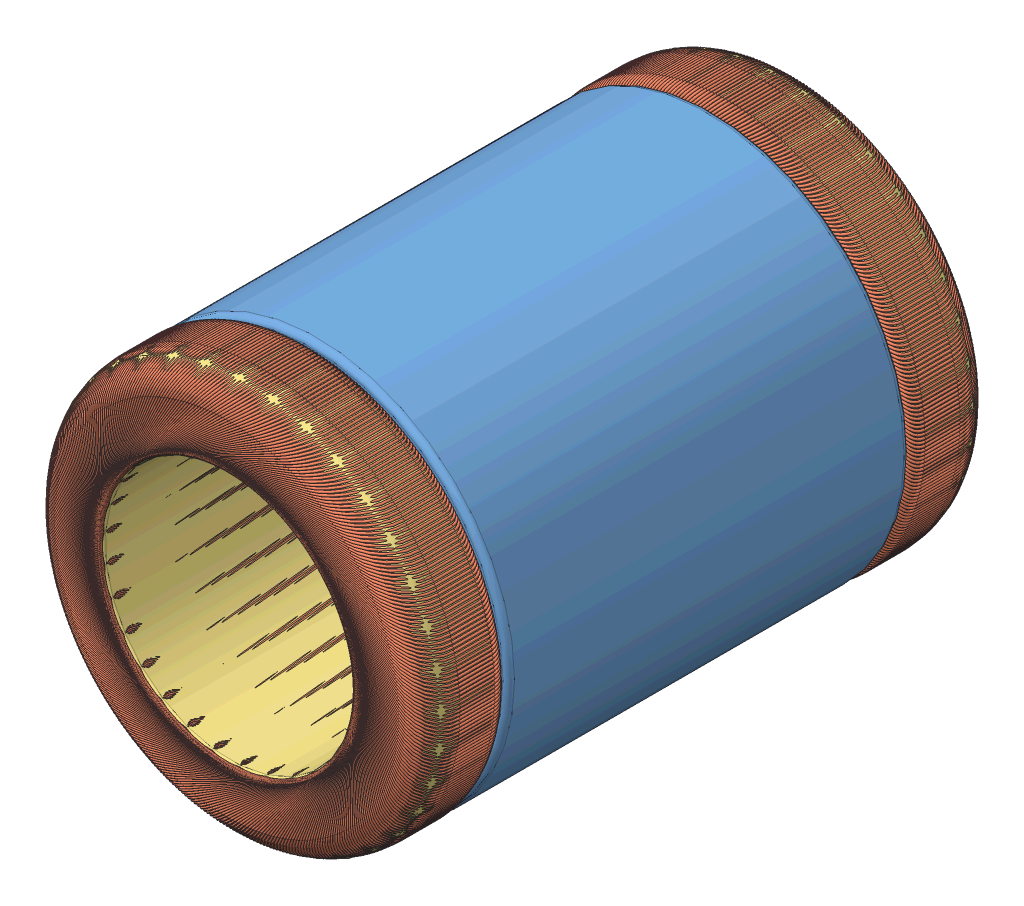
SolidWorks assembly T2M-Moteur Bruschless-Stator bobine.SLDASM, configuration Défaut (file format 6000). Lengths in mm.
Overall size (48.02 48.02 49.2).
362 component instances, 3 part files, 1 mates.
Components (placement in the parent):
- T2M-Moteur Bruschless-Stator-1: T2M-Moteur Bruschless-Stator.SLDPRT [Défaut] at origin size (34 34 34.5)
- T2M-Moteur Bruschless-Fil bobinage-1: T2M-Moteur Bruschless-Fil bobinage.SLDPRT [Défaut] at (7.9212 9.5445 -7.2784) x (0 0 1) z (-0.181516 -0.983388 0) size (49.2 14.21 0.2)
- T2M-Moteur Bruschless-Fil bobinage-2: T2M-Moteur Bruschless-Fil bobinage.SLDPRT [Défaut] at (8.0866 9.4048 -7.2784) x (0 0 1) z (-0.198651 -0.98007 0) size (49.2 14.21 0.2)
- T2M-Moteur Bruschless-Fil bobinage-3: T2M-Moteur Bruschless-Fil bobinage.SLDPRT [Défaut] at (8.2495 9.2622 -7.2784) x (0 0 1) z (-0.215725 -0.976454 0) size (49.2 14.21 0.2)
- T2M-Moteur Bruschless-Fil bobinage-4: T2M-Moteur Bruschless-Fil bobinage.SLDPRT [Défaut] at (8.4099 9.1168 -7.2784) x (0 0 1) z (-0.232734 -0.972541 0) size (49.2 14.21 0.2)
- T2M-Moteur Bruschless-Fil bobinage-5: T2M-Moteur Bruschless-Fil bobinage.SLDPRT [Défaut] at (8.5677 8.9687 -7.2784) x (0 0 1) z (-0.249671 -0.968331 0) size (49.2 14.21 0.2)
- T2M-Moteur Bruschless-Fil bobinage-6: T2M-Moteur Bruschless-Fil bobinage.SLDPRT [Défaut] at (8.7229 8.8178 -7.2784) x (0 0 1) z (-0.266533 -0.963826 0) size (49.2 14.21 0.2)
- T2M-Moteur Bruschless-Fil bobinage-7: T2M-Moteur Bruschless-Fil bobinage.SLDPRT [Défaut] at (8.8755 8.6642 -7.2784) x (0 0 1) z (-0.283314 -0.959027 0) size (49.2 14.21 0.2)
- T2M-Moteur Bruschless-Fil bobinage-8: T2M-Moteur Bruschless-Fil bobinage.SLDPRT [Défaut] at (9.0253 8.508 -7.2784) x (0 0 1) z (-0.300008 -0.953937 0) size (49.2 14.21 0.2)
- T2M-Moteur Bruschless-Fil bobinage-9: T2M-Moteur Bruschless-Fil bobinage.SLDPRT [Défaut] at (9.1725 8.3492 -7.2784) x (0 0 1) z (-0.316611 -0.948556 0) size (49.2 14.21 0.2)
- T2M-Moteur Bruschless-Fil bobinage-10: T2M-Moteur Bruschless-Fil bobinage.SLDPRT [Défaut] at (9.3168 8.1878 -7.2784) x (0 0 1) z (-0.333117 -0.942886 0) size (49.2 14.21 0.2)
- T2M-Moteur Bruschless-Fil bobinage-11: T2M-Moteur Bruschless-Fil bobinage.SLDPRT [Défaut] at (9.4582 8.024 -7.2784) x (0 0 1) z (-0.349522 -0.936928 0) size (49.2 14.21 0.2)
- T2M-Moteur Bruschless-Fil bobinage-12: T2M-Moteur Bruschless-Fil bobinage.SLDPRT [Défaut] at (9.5968 7.8577 -7.2784) x (0 0 1) z (-0.36582 -0.930686 0) size (49.2 14.21 0.2)
- T2M-Moteur Bruschless-Fil bobinage-13: T2M-Moteur Bruschless-Fil bobinage.SLDPRT [Défaut] at (9.7325 7.689 -7.2784) x (0 0 1) z (-0.382007 -0.924159 0) size (49.2 14.21 0.2)
- T2M-Moteur Bruschless-Fil bobinage-14: T2M-Moteur Bruschless-Fil bobinage.SLDPRT [Défaut] at (9.8652 7.518 -7.2784) x (0 0 1) z (-0.398078 -0.917352 0) size (49.2 14.21 0.2)
- T2M-Moteur Bruschless-Fil bobinage-15: T2M-Moteur Bruschless-Fil bobinage.SLDPRT [Défaut] at (9.9949 7.3446 -7.2784) x (0 0 1) z (-0.414027 -0.910265 0) size (49.2 14.21 0.2)
- T2M-Moteur Bruschless-Fil bobinage-16: T2M-Moteur Bruschless-Fil bobinage.SLDPRT [Défaut] at (10.1216 7.1691 -7.2784) x (0 0 1) z (-0.42985 -0.9029 0) size (49.2 14.21 0.2)
- T2M-Moteur Bruschless-Fil bobinage-17: T2M-Moteur Bruschless-Fil bobinage.SLDPRT [Défaut] at (10.2452 6.9914 -7.2784) x (0 0 1) z (-0.445543 -0.895261 0) size (49.2 14.21 0.2)
- T2M-Moteur Bruschless-Fil bobinage-18: T2M-Moteur Bruschless-Fil bobinage.SLDPRT [Défaut] at (10.3656 6.8115 -7.2784) x (0 0 1) z (-0.461099 -0.887349 0) size (49.2 14.21 0.2)
- T2M-Moteur Bruschless-Fil bobinage-19: T2M-Moteur Bruschless-Fil bobinage.SLDPRT [Défaut] at (10.4829 6.6295 -7.2784) x (0 0 1) z (-0.476515 -0.879166 0) size (49.2 14.21 0.2)
- T2M-Moteur Bruschless-Fil bobinage-20: T2M-Moteur Bruschless-Fil bobinage.SLDPRT [Défaut] at (10.597 6.4456 -7.2784) x (0 0 1) z (-0.491786 -0.870716 0) size (49.2 14.21 0.2)
- T2M-Moteur Bruschless-Fil bobinage-21: T2M-Moteur Bruschless-Fil bobinage.SLDPRT [Défaut] at (10.7079 6.2597 -7.2784) x (0 0 1) z (-0.506908 -0.862 0) size (49.2 14.21 0.2)
- T2M-Moteur Bruschless-Fil bobinage-22: T2M-Moteur Bruschless-Fil bobinage.SLDPRT [Défaut] at (10.8155 6.0718 -7.2784) x (0 0 1) z (-0.521874 -0.853022 0) size (49.2 14.21 0.2)
- T2M-Moteur Bruschless-Fil bobinage-23: T2M-Moteur Bruschless-Fil bobinage.SLDPRT [Défaut] at (10.9198 5.8821 -7.2784) x (0 0 1) z (-0.536682 -0.843784 0) size (49.2 14.21 0.2)
- T2M-Moteur Bruschless-Fil bobinage-24: T2M-Moteur Bruschless-Fil bobinage.SLDPRT [Défaut] at (11.0208 5.6907 -7.2784) x (0 0 1) z (-0.551327 -0.83429 0) size (49.2 14.21 0.2)
- T2M-Moteur Bruschless-Fil bobinage-25: T2M-Moteur Bruschless-Fil bobinage.SLDPRT [Défaut] at (11.1185 5.4975 -7.2784) x (0 0 1) z (-0.565803 -0.824541 0) size (49.2 14.21 0.2)
- T2M-Moteur Bruschless-Fil bobinage-26: T2M-Moteur Bruschless-Fil bobinage.SLDPRT [Défaut] at (11.2127 5.3026 -7.2784) x (0 0 1) z (-0.580107 -0.81454 0) size (49.2 14.21 0.2)
- T2M-Moteur Bruschless-Fil bobinage-27: T2M-Moteur Bruschless-Fil bobinage.SLDPRT [Défaut] at (11.3036 5.1061 -7.2784) x (0 0 1) z (-0.594234 -0.804292 0) size (49.2 14.21 0.2)
- T2M-Moteur Bruschless-Fil bobinage-28: T2M-Moteur Bruschless-Fil bobinage.SLDPRT [Défaut] at (11.3909 4.908 -7.2784) x (0 0 1) z (-0.608181 -0.793799 0) size (49.2 14.21 0.2)
- T2M-Moteur Bruschless-Fil bobinage-29: T2M-Moteur Bruschless-Fil bobinage.SLDPRT [Défaut] at (11.4749 4.7085 -7.2784) x (0 0 1) z (-0.621942 -0.783064 0) size (49.2 14.21 0.2)
- T2M-Moteur Bruschless-Fil bobinage-30: T2M-Moteur Bruschless-Fil bobinage.SLDPRT [Défaut] at (11.5553 4.5075 -7.2784) x (0 0 1) z (-0.635513 -0.77209 0) size (49.2 14.21 0.2)
- T2M-Moteur Bruschless-Fil bobinage-31: T2M-Moteur Bruschless-Fil bobinage.SLDPRT [Défaut] at (11.6322 4.3052 -7.2784) x (0 0 1) z (-0.648891 -0.760881 0) size (49.2 14.21 0.2)
- T2M-Moteur Bruschless-Fil bobinage-32: T2M-Moteur Bruschless-Fil bobinage.SLDPRT [Défaut] at (11.7056 4.1015 -7.2784) x (0 0 1) z (-0.662072 -0.74944 0) size (49.2 14.21 0.2)
- T2M-Moteur Bruschless-Fil bobinage-33: T2M-Moteur Bruschless-Fil bobinage.SLDPRT [Défaut] at (11.7754 3.8966 -7.2784) x (0 0 1) z (-0.67505 -0.737772 0) size (49.2 14.21 0.2)
- T2M-Moteur Bruschless-Fil bobinage-34: T2M-Moteur Bruschless-Fil bobinage.SLDPRT [Défaut] at (11.8416 3.6905 -7.2784) x (0 0 1) z (-0.687824 -0.725878 0) size (49.2 14.21 0.2)
- T2M-Moteur Bruschless-Fil bobinage-35: T2M-Moteur Bruschless-Fil bobinage.SLDPRT [Défaut] at (11.9042 3.4832 -7.2784) x (0 0 1) z (-0.700387 -0.713763 0) size (49.2 14.21 0.2)
- T2M-Moteur Bruschless-Fil bobinage-36: T2M-Moteur Bruschless-Fil bobinage.SLDPRT [Défaut] at (11.9632 3.275 -7.2784) x (0 0 1) z (-0.712737 -0.701431 0) size (49.2 14.21 0.2)
- T2M-Moteur Bruschless-Fil bobinage-37: T2M-Moteur Bruschless-Fil bobinage.SLDPRT [Défaut] at (12.0185 3.0657 -7.2784) x (0 0 1) z (-0.72487 -0.688885 0) size (49.2 14.21 0.2)
- T2M-Moteur Bruschless-Fil bobinage-38: T2M-Moteur Bruschless-Fil bobinage.SLDPRT [Défaut] at (12.0702 2.8555 -7.2784) x (0 0 1) z (-0.736783 -0.67613 0) size (49.2 14.21 0.2)
- T2M-Moteur Bruschless-Fil bobinage-39: T2M-Moteur Bruschless-Fil bobinage.SLDPRT [Défaut] at (12.1182 2.6444 -7.2784) x (0 0 1) z (-0.748471 -0.663168 0) size (49.2 14.21 0.2)
- T2M-Moteur Bruschless-Fil bobinage-40: T2M-Moteur Bruschless-Fil bobinage.SLDPRT [Défaut] at (12.1625 2.4325 -7.2784) x (0 0 1) z (-0.75993 -0.650004 0) size (49.2 14.21 0.2)
- T2M-Moteur Bruschless-Fil bobinage-41: T2M-Moteur Bruschless-Fil bobinage.SLDPRT [Défaut] at (12.2031 2.2198 -7.2784) x (0 0 1) z (-0.771159 -0.636643 0) size (49.2 14.21 0.2)
- T2M-Moteur Bruschless-Fil bobinage-42: T2M-Moteur Bruschless-Fil bobinage.SLDPRT [Défaut] at (12.24 2.0065 -7.2784) x (0 0 1) z (-0.782152 -0.623087 0) size (49.2 14.21 0.2)
- T2M-Moteur Bruschless-Fil bobinage-43: T2M-Moteur Bruschless-Fil bobinage.SLDPRT [Défaut] at (12.2731 1.7926 -7.2784) x (0 0 1) z (-0.792908 -0.609342 0) size (49.2 14.21 0.2)
- T2M-Moteur Bruschless-Fil bobinage-44: T2M-Moteur Bruschless-Fil bobinage.SLDPRT [Défaut] at (12.3025 1.5781 -7.2784) x (0 0 1) z (-0.803421 -0.595411 0) size (49.2 14.21 0.2)
- T2M-Moteur Bruschless-Fil bobinage-45: T2M-Moteur Bruschless-Fil bobinage.SLDPRT [Défaut] at (12.3282 1.3632 -7.2784) x (0 0 1) z (-0.81369 -0.581299 0) size (49.2 14.21 0.2)
- T2M-Moteur Bruschless-Fil bobinage-46: T2M-Moteur Bruschless-Fil bobinage.SLDPRT [Défaut] at (12.3501 1.1478 -7.2784) x (0 0 1) z (-0.823711 -0.567009 0) size (49.2 14.21 0.2)
- T2M-Moteur Bruschless-Fil bobinage-47: T2M-Moteur Bruschless-Fil bobinage.SLDPRT [Défaut] at (12.3683 0.9321 -7.2784) x (0 0 1) z (-0.833482 -0.552547 0) size (49.2 14.21 0.2)
- T2M-Moteur Bruschless-Fil bobinage-48: T2M-Moteur Bruschless-Fil bobinage.SLDPRT [Défaut] at (12.3826 0.7161 -7.2784) x (0 0 1) z (-0.842998 -0.537917 0) size (49.2 14.21 0.2)
- T2M-Moteur Bruschless-Fil bobinage-49: T2M-Moteur Bruschless-Fil bobinage.SLDPRT [Défaut] at (12.3933 0.4999 -7.2784) x (0 0 1) z (-0.852258 -0.523122 0) size (49.2 14.21 0.2)
- T2M-Moteur Bruschless-Fil bobinage-50: T2M-Moteur Bruschless-Fil bobinage.SLDPRT [Défaut] at (12.4001 0.2835 -7.2784) x (0 0 1) z (-0.861257 -0.508169 0) size (49.2 14.21 0.2)
- T2M-Moteur Bruschless-Fil bobinage-51: T2M-Moteur Bruschless-Fil bobinage.SLDPRT [Défaut] at (12.4031 0.0671 -7.2784) x (0 0 1) z (-0.869995 -0.49306 0) size (49.2 14.21 0.2)
- T2M-Moteur Bruschless-Fil bobinage-52: T2M-Moteur Bruschless-Fil bobinage.SLDPRT [Défaut] at (12.4024 -0.1494 -7.2784) x (0 0 1) z (-0.878468 -0.477802 0) size (49.2 14.21 0.2)
- T2M-Moteur Bruschless-Fil bobinage-53: T2M-Moteur Bruschless-Fil bobinage.SLDPRT [Défaut] at (12.3979 -0.3658 -7.2784) x (0 0 1) z (-0.886673 -0.462398 0) size (49.2 14.21 0.2)
- T2M-Moteur Bruschless-Fil bobinage-54: T2M-Moteur Bruschless-Fil bobinage.SLDPRT [Défaut] at (12.3897 -0.5821 -7.2784) x (0 0 1) z (-0.894608 -0.446853 0) size (49.2 14.21 0.2)
- T2M-Moteur Bruschless-Fil bobinage-55: T2M-Moteur Bruschless-Fil bobinage.SLDPRT [Défaut] at (12.3776 -0.7983 -7.2784) x (0 0 1) z (-0.90227 -0.431172 0) size (49.2 14.21 0.2)
- T2M-Moteur Bruschless-Fil bobinage-56: T2M-Moteur Bruschless-Fil bobinage.SLDPRT [Défaut] at (12.3618 -1.0142 -7.2784) x (0 0 1) z (-0.909658 -0.415359 0) size (49.2 14.21 0.2)
- T2M-Moteur Bruschless-Fil bobinage-57: T2M-Moteur Bruschless-Fil bobinage.SLDPRT [Défaut] at (12.3422 -1.2298 -7.2784) x (0 0 1) z (-0.916768 -0.39942 0) size (49.2 14.21 0.2)
- T2M-Moteur Bruschless-Fil bobinage-58: T2M-Moteur Bruschless-Fil bobinage.SLDPRT [Défaut] at (12.3189 -1.445 -7.2784) x (0 0 1) z (-0.923599 -0.383359 0) size (49.2 14.21 0.2)
- T2M-Moteur Bruschless-Fil bobinage-59: T2M-Moteur Bruschless-Fil bobinage.SLDPRT [Défaut] at (12.2918 -1.6598 -7.2784) x (0 0 1) z (-0.930149 -0.367182 0) size (49.2 14.21 0.2)
- T2M-Moteur Bruschless-Fil bobinage-60: T2M-Moteur Bruschless-Fil bobinage.SLDPRT [Défaut] at (12.2609 -1.874 -7.2784) x (0 0 1) z (-0.936416 -0.350893 0) size (49.2 14.21 0.2)
- T2M-Moteur Bruschless-Fil bobinage-61: T2M-Moteur Bruschless-Fil bobinage.SLDPRT [Défaut] at (12.2264 -2.0877 -7.2784) x (0 0 1) z (-0.942397 -0.334497 0) size (49.2 14.21 0.2)
- T2M-Moteur Bruschless-Fil bobinage-62: T2M-Moteur Bruschless-Fil bobinage.SLDPRT [Défaut] at (12.1881 -2.3008 -7.2784) x (0 0 1) z (-0.948091 -0.317999 0) size (49.2 14.21 0.2)
- T2M-Moteur Bruschless-Fil bobinage-63: T2M-Moteur Bruschless-Fil bobinage.SLDPRT [Défaut] at (12.1461 -2.5132 -7.2784) x (0 0 1) z (-0.953497 -0.301404 0) size (49.2 14.21 0.2)
- T2M-Moteur Bruschless-Fil bobinage-64: T2M-Moteur Bruschless-Fil bobinage.SLDPRT [Défaut] at (12.1003 -2.7247 -7.2784) x (0 0 1) z (-0.958612 -0.284717 0) size (49.2 14.21 0.2)
- T2M-Moteur Bruschless-Fil bobinage-65: T2M-Moteur Bruschless-Fil bobinage.SLDPRT [Défaut] at (12.0509 -2.9355 -7.2784) x (0 0 1) z (-0.963435 -0.267944 0) size (49.2 14.21 0.2)
- T2M-Moteur Bruschless-Fil bobinage-66: T2M-Moteur Bruschless-Fil bobinage.SLDPRT [Défaut] at (11.9979 -3.1454 -7.2784) x (0 0 1) z (-0.967964 -0.251089 0) size (49.2 14.21 0.2)
- T2M-Moteur Bruschless-Fil bobinage-67: T2M-Moteur Bruschless-Fil bobinage.SLDPRT [Défaut] at (11.9412 -3.3543 -7.2784) x (0 0 1) z (-0.972199 -0.234157 0) size (49.2 14.21 0.2)
- T2M-Moteur Bruschless-Fil bobinage-68: T2M-Moteur Bruschless-Fil bobinage.SLDPRT [Défaut] at (11.8808 -3.5622 -7.2784) x (0 0 1) z (-0.976137 -0.217154 0) size (49.2 14.21 0.2)
- T2M-Moteur Bruschless-Fil bobinage-69: T2M-Moteur Bruschless-Fil bobinage.SLDPRT [Défaut] at (11.8168 -3.769 -7.2784) x (0 0 1) z (-0.979779 -0.200085 0) size (49.2 14.21 0.2)
- T2M-Moteur Bruschless-Fil bobinage-70: T2M-Moteur Bruschless-Fil bobinage.SLDPRT [Défaut] at (11.7492 -3.9747 -7.2784) x (0 0 1) z (-0.983121 -0.182955 0) size (49.2 14.21 0.2)
- T2M-Moteur Bruschless-Fil bobinage-71: T2M-Moteur Bruschless-Fil bobinage.SLDPRT [Défaut] at (11.6781 -4.1791 -7.2784) x (0 0 1) z (-0.986165 -0.165769 0) size (49.2 14.21 0.2)
- T2M-Moteur Bruschless-Fil bobinage-72: T2M-Moteur Bruschless-Fil bobinage.SLDPRT [Défaut] at (11.6034 -4.3823 -7.2784) x (0 0 1) z (-0.988907 -0.148533 0) size (49.2 14.21 0.2)
- T2M-Moteur Bruschless-Fil bobinage-73: T2M-Moteur Bruschless-Fil bobinage.SLDPRT [Défaut] at (11.5251 -4.5841 -7.2784) x (0 0 1) z (-0.991349 -0.131252 0) size (49.2 14.21 0.2)
- T2M-Moteur Bruschless-Fil bobinage-74: T2M-Moteur Bruschless-Fil bobinage.SLDPRT [Défaut] at (11.4434 -4.7846 -7.2784) x (0 0 1) z (-0.993489 -0.11393 0) size (49.2 14.21 0.2)
- T2M-Moteur Bruschless-Fil bobinage-75: T2M-Moteur Bruschless-Fil bobinage.SLDPRT [Défaut] at (11.3581 -4.9835 -7.2784) x (0 0 1) z (-0.995326 -0.096574 0) size (49.2 14.21 0.2)
- T2M-Moteur Bruschless-Fil bobinage-76: T2M-Moteur Bruschless-Fil bobinage.SLDPRT [Défaut] at (11.2694 -5.181 -7.2784) x (0 0 1) z (-0.99686 -0.079189 0) size (49.2 14.21 0.2)
- T2M-Moteur Bruschless-Fil bobinage-77: T2M-Moteur Bruschless-Fil bobinage.SLDPRT [Défaut] at (11.1773 -5.3769 -7.2784) x (0 0 1) z (-0.99809 -0.061779 0) size (49.2 14.21 0.2)
- T2M-Moteur Bruschless-Fil bobinage-78: T2M-Moteur Bruschless-Fil bobinage.SLDPRT [Défaut] at (11.0817 -5.5711 -7.2784) x (0 0 1) z (-0.999016 -0.044351 0) size (49.2 14.21 0.2)
- T2M-Moteur Bruschless-Fil bobinage-79: T2M-Moteur Bruschless-Fil bobinage.SLDPRT [Défaut] at (10.9828 -5.7637 -7.2784) x (0 0 1) z (-0.999638 -0.026909 0) size (49.2 14.21 0.2)
- T2M-Moteur Bruschless-Fil bobinage-80: T2M-Moteur Bruschless-Fil bobinage.SLDPRT [Défaut] at (10.8806 -5.9545 -7.2784) x (0 0 1) z (-0.999955 -0.009458 0) size (49.2 14.21 0.2)
- T2M-Moteur Bruschless-Fil bobinage-81: T2M-Moteur Bruschless-Fil bobinage.SLDPRT [Défaut] at (10.775 -6.1435 -7.2784) x (0 0 1) z (-0.999968 0.007995 0) size (49.2 14.21 0.2)
- T2M-Moteur Bruschless-Fil bobinage-82: T2M-Moteur Bruschless-Fil bobinage.SLDPRT [Défaut] at (10.6661 -6.3306 -7.2784) x (0 0 1) z (-0.999676 0.025445 0) size (49.2 14.21 0.2)
- T2M-Moteur Bruschless-Fil bobinage-83: T2M-Moteur Bruschless-Fil bobinage.SLDPRT [Défaut] at (10.554 -6.5158 -7.2784) x (0 0 1) z (-0.99908 0.042888 0) size (49.2 14.21 0.2)
- T2M-Moteur Bruschless-Fil bobinage-84: T2M-Moteur Bruschless-Fil bobinage.SLDPRT [Défaut] at (10.4387 -6.699 -7.2784) x (0 0 1) z (-0.998179 0.060318 0) size (49.2 14.21 0.2)
- T2M-Moteur Bruschless-Fil bobinage-85: T2M-Moteur Bruschless-Fil bobinage.SLDPRT [Défaut] at (10.3202 -6.8801 -7.2784) x (0 0 1) z (-0.996974 0.077729 0) size (49.2 14.21 0.2)
- T2M-Moteur Bruschless-Fil bobinage-86: T2M-Moteur Bruschless-Fil bobinage.SLDPRT [Défaut] at (10.1985 -7.0592 -7.2784) x (0 0 1) z (-0.995466 0.095117 0) size (49.2 14.21 0.2)
- T2M-Moteur Bruschless-Fil bobinage-87: T2M-Moteur Bruschless-Fil bobinage.SLDPRT [Défaut] at (10.0738 -7.2361 -7.2784) x (0 0 1) z (-0.993654 0.112476 0) size (49.2 14.21 0.2)
- T2M-Moteur Bruschless-Fil bobinage-88: T2M-Moteur Bruschless-Fil bobinage.SLDPRT [Défaut] at (9.946 -7.4108 -7.2784) x (0 0 1) z (-0.99154 0.129801 0) size (49.2 14.21 0.2)
- T2M-Moteur Bruschless-Fil bobinage-89: T2M-Moteur Bruschless-Fil bobinage.SLDPRT [Défaut] at (9.8151 -7.5833 -7.2784) x (0 0 1) z (-0.989124 0.147086 0) size (49.2 14.21 0.2)
- T2M-Moteur Bruschless-Fil bobinage-90: T2M-Moteur Bruschless-Fil bobinage.SLDPRT [Défaut] at (9.6813 -7.7534 -7.2784) x (0 0 1) z (-0.986406 0.164326 0) size (49.2 14.21 0.2)
- T2M-Moteur Bruschless-Fil bobinage-91: T2M-Moteur Bruschless-Fil bobinage.SLDPRT [Défaut] at (9.5445 -7.9212 -7.2784) x (0 0 1) z (-0.983388 0.181516 0) size (49.2 14.21 0.2)
- T2M-Moteur Bruschless-Fil bobinage-92: T2M-Moteur Bruschless-Fil bobinage.SLDPRT [Défaut] at (9.4048 -8.0866 -7.2784) x (0 0 1) z (-0.98007 0.198651 0) size (49.2 14.21 0.2)
- T2M-Moteur Bruschless-Fil bobinage-93: T2M-Moteur Bruschless-Fil bobinage.SLDPRT [Défaut] at (9.2622 -8.2495 -7.2784) x (0 0 1) z (-0.976454 0.215725 0) size (49.2 14.21 0.2)
- T2M-Moteur Bruschless-Fil bobinage-94: T2M-Moteur Bruschless-Fil bobinage.SLDPRT [Défaut] at (9.1168 -8.4099 -7.2784) x (0 0 1) z (-0.972541 0.232734 0) size (49.2 14.21 0.2)
- T2M-Moteur Bruschless-Fil bobinage-95: T2M-Moteur Bruschless-Fil bobinage.SLDPRT [Défaut] at (8.9687 -8.5677 -7.2784) x (0 0 1) z (-0.968331 0.249671 0) size (49.2 14.21 0.2)
- T2M-Moteur Bruschless-Fil bobinage-96: T2M-Moteur Bruschless-Fil bobinage.SLDPRT [Défaut] at (8.8178 -8.7229 -7.2784) x (0 0 1) z (-0.963826 0.266533 0) size (49.2 14.21 0.2)
- T2M-Moteur Bruschless-Fil bobinage-97: T2M-Moteur Bruschless-Fil bobinage.SLDPRT [Défaut] at (8.6642 -8.8755 -7.2784) x (0 0 1) z (-0.959027 0.283314 0) size (49.2 14.21 0.2)
- T2M-Moteur Bruschless-Fil bobinage-98: T2M-Moteur Bruschless-Fil bobinage.SLDPRT [Défaut] at (8.508 -9.0253 -7.2784) x (0 0 1) z (-0.953937 0.300008 0) size (49.2 14.21 0.2)
- T2M-Moteur Bruschless-Fil bobinage-99: T2M-Moteur Bruschless-Fil bobinage.SLDPRT [Défaut] at (8.3492 -9.1725 -7.2784) x (0 0 1) z (-0.948556 0.316611 0) size (49.2 14.21 0.2)
- T2M-Moteur Bruschless-Fil bobinage-100: T2M-Moteur Bruschless-Fil bobinage.SLDPRT [Défaut] at (8.1878 -9.3168 -7.2784) x (0 0 1) z (-0.942886 0.333117 0) size (49.2 14.21 0.2)
- T2M-Moteur Bruschless-Fil bobinage-101: T2M-Moteur Bruschless-Fil bobinage.SLDPRT [Défaut] at (8.024 -9.4582 -7.2784) x (0 0 1) z (-0.936928 0.349522 0) size (49.2 14.21 0.2)
- T2M-Moteur Bruschless-Fil bobinage-102: T2M-Moteur Bruschless-Fil bobinage.SLDPRT [Défaut] at (7.8577 -9.5968 -7.2784) x (0 0 1) z (-0.930686 0.36582 0) size (49.2 14.21 0.2)
- T2M-Moteur Bruschless-Fil bobinage-103: T2M-Moteur Bruschless-Fil bobinage.SLDPRT [Défaut] at (7.689 -9.7325 -7.2784) x (0 0 1) z (-0.924159 0.382007 0) size (49.2 14.21 0.2)
- T2M-Moteur Bruschless-Fil bobinage-104: T2M-Moteur Bruschless-Fil bobinage.SLDPRT [Défaut] at (7.518 -9.8652 -7.2784) x (0 0 1) z (-0.917352 0.398078 0) size (49.2 14.21 0.2)
- T2M-Moteur Bruschless-Fil bobinage-105: T2M-Moteur Bruschless-Fil bobinage.SLDPRT [Défaut] at (7.3446 -9.9949 -7.2784) x (0 0 1) z (-0.910265 0.414027 0) size (49.2 14.21 0.2)
- T2M-Moteur Bruschless-Fil bobinage-106: T2M-Moteur Bruschless-Fil bobinage.SLDPRT [Défaut] at (7.1691 -10.1216 -7.2784) x (0 0 1) z (-0.9029 0.42985 0) size (49.2 14.21 0.2)
- T2M-Moteur Bruschless-Fil bobinage-107: T2M-Moteur Bruschless-Fil bobinage.SLDPRT [Défaut] at (6.9914 -10.2452 -7.2784) x (0 0 1) z (-0.895261 0.445543 0) size (49.2 14.21 0.2)
- T2M-Moteur Bruschless-Fil bobinage-108: T2M-Moteur Bruschless-Fil bobinage.SLDPRT [Défaut] at (6.8115 -10.3656 -7.2784) x (0 0 1) z (-0.887349 0.461099 0) size (49.2 14.21 0.2)
- T2M-Moteur Bruschless-Fil bobinage-109: T2M-Moteur Bruschless-Fil bobinage.SLDPRT [Défaut] at (6.6295 -10.4829 -7.2784) x (0 0 1) z (-0.879166 0.476515 0) size (49.2 14.21 0.2)
- T2M-Moteur Bruschless-Fil bobinage-110: T2M-Moteur Bruschless-Fil bobinage.SLDPRT [Défaut] at (6.4456 -10.597 -7.2784) x (0 0 1) z (-0.870716 0.491786 0) size (49.2 14.21 0.2)
- T2M-Moteur Bruschless-Fil bobinage-111: T2M-Moteur Bruschless-Fil bobinage.SLDPRT [Défaut] at (6.2597 -10.7079 -7.2784) x (0 0 1) z (-0.862 0.506908 0) size (49.2 14.21 0.2)
- T2M-Moteur Bruschless-Fil bobinage-112: T2M-Moteur Bruschless-Fil bobinage.SLDPRT [Défaut] at (6.0718 -10.8155 -7.2784) x (0 0 1) z (-0.853022 0.521874 0) size (49.2 14.21 0.2)
- T2M-Moteur Bruschless-Fil bobinage-113: T2M-Moteur Bruschless-Fil bobinage.SLDPRT [Défaut] at (5.8821 -10.9198 -7.2784) x (0 0 1) z (-0.843784 0.536682 0) size (49.2 14.21 0.2)
- T2M-Moteur Bruschless-Fil bobinage-114: T2M-Moteur Bruschless-Fil bobinage.SLDPRT [Défaut] at (5.6907 -11.0208 -7.2784) x (0 0 1) z (-0.83429 0.551327 0) size (49.2 14.21 0.2)
- T2M-Moteur Bruschless-Fil bobinage-115: T2M-Moteur Bruschless-Fil bobinage.SLDPRT [Défaut] at (5.4975 -11.1185 -7.2784) x (0 0 1) z (-0.824541 0.565803 0) size (49.2 14.21 0.2)
- T2M-Moteur Bruschless-Fil bobinage-116: T2M-Moteur Bruschless-Fil bobinage.SLDPRT [Défaut] at (5.3026 -11.2127 -7.2784) x (0 0 1) z (-0.81454 0.580107 0) size (49.2 14.21 0.2)
- T2M-Moteur Bruschless-Fil bobinage-117: T2M-Moteur Bruschless-Fil bobinage.SLDPRT [Défaut] at (5.1061 -11.3036 -7.2784) x (0 0 1) z (-0.804292 0.594234 0) size (49.2 14.21 0.2)
- T2M-Moteur Bruschless-Fil bobinage-118: T2M-Moteur Bruschless-Fil bobinage.SLDPRT [Défaut] at (4.908 -11.3909 -7.2784) x (0 0 1) z (-0.793799 0.608181 0) size (49.2 14.21 0.2)
- T2M-Moteur Bruschless-Fil bobinage-119: T2M-Moteur Bruschless-Fil bobinage.SLDPRT [Défaut] at (4.7085 -11.4749 -7.2784) x (0 0 1) z (-0.783064 0.621942 0) size (49.2 14.21 0.2)
- T2M-Moteur Bruschless-Fil bobinage-120: T2M-Moteur Bruschless-Fil bobinage.SLDPRT [Défaut] at (4.5075 -11.5553 -7.2784) x (0 0 1) z (-0.77209 0.635513 0) size (49.2 14.21 0.2)
- T2M-Moteur Bruschless-Fil bobinage-121: T2M-Moteur Bruschless-Fil bobinage.SLDPRT [Défaut] at (4.3052 -11.6322 -7.2784) x (0 0 1) z (-0.760881 0.648891 0) size (49.2 14.21 0.2)
- T2M-Moteur Bruschless-Fil bobinage-122: T2M-Moteur Bruschless-Fil bobinage.SLDPRT [Défaut] at (4.1015 -11.7056 -7.2784) x (0 0 1) z (-0.74944 0.662072 0) size (49.2 14.21 0.2)
- T2M-Moteur Bruschless-Fil bobinage-123: T2M-Moteur Bruschless-Fil bobinage.SLDPRT [Défaut] at (3.8966 -11.7754 -7.2784) x (0 0 1) z (-0.737772 0.67505 0) size (49.2 14.21 0.2)
- T2M-Moteur Bruschless-Fil bobinage-124: T2M-Moteur Bruschless-Fil bobinage.SLDPRT [Défaut] at (3.6905 -11.8416 -7.2784) x (0 0 1) z (-0.725878 0.687824 0) size (49.2 14.21 0.2)
- T2M-Moteur Bruschless-Fil bobinage-125: T2M-Moteur Bruschless-Fil bobinage.SLDPRT [Défaut] at (3.4832 -11.9042 -7.2784) x (0 0 1) z (-0.713763 0.700387 0) size (49.2 14.21 0.2)
- T2M-Moteur Bruschless-Fil bobinage-126: T2M-Moteur Bruschless-Fil bobinage.SLDPRT [Défaut] at (3.275 -11.9632 -7.2784) x (0 0 1) z (-0.701431 0.712737 0) size (49.2 14.21 0.2)
- T2M-Moteur Bruschless-Fil bobinage-127: T2M-Moteur Bruschless-Fil bobinage.SLDPRT [Défaut] at (3.0657 -12.0185 -7.2784) x (0 0 1) z (-0.688885 0.72487 0) size (49.2 14.21 0.2)
- T2M-Moteur Bruschless-Fil bobinage-128: T2M-Moteur Bruschless-Fil bobinage.SLDPRT [Défaut] at (2.8555 -12.0702 -7.2784) x (0 0 1) z (-0.67613 0.736783 0) size (49.2 14.21 0.2)
- T2M-Moteur Bruschless-Fil bobinage-129: T2M-Moteur Bruschless-Fil bobinage.SLDPRT [Défaut] at (2.6444 -12.1182 -7.2784) x (0 0 1) z (-0.663168 0.748471 0) size (49.2 14.21 0.2)
- T2M-Moteur Bruschless-Fil bobinage-130: T2M-Moteur Bruschless-Fil bobinage.SLDPRT [Défaut] at (2.4325 -12.1625 -7.2784) x (0 0 1) z (-0.650004 0.75993 0) size (49.2 14.21 0.2)
- T2M-Moteur Bruschless-Fil bobinage-131: T2M-Moteur Bruschless-Fil bobinage.SLDPRT [Défaut] at (2.2198 -12.2031 -7.2784) x (0 0 1) z (-0.636643 0.771159 0) size (49.2 14.21 0.2)
- T2M-Moteur Bruschless-Fil bobinage-132: T2M-Moteur Bruschless-Fil bobinage.SLDPRT [Défaut] at (2.0065 -12.24 -7.2784) x (0 0 1) z (-0.623087 0.782152 0) size (49.2 14.21 0.2)
- T2M-Moteur Bruschless-Fil bobinage-133: T2M-Moteur Bruschless-Fil bobinage.SLDPRT [Défaut] at (1.7926 -12.2731 -7.2784) x (0 0 1) z (-0.609342 0.792908 0) size (49.2 14.21 0.2)
- T2M-Moteur Bruschless-Fil bobinage-134: T2M-Moteur Bruschless-Fil bobinage.SLDPRT [Défaut] at (1.5781 -12.3025 -7.2784) x (0 0 1) z (-0.595411 0.803421 0) size (49.2 14.21 0.2)
- T2M-Moteur Bruschless-Fil bobinage-135: T2M-Moteur Bruschless-Fil bobinage.SLDPRT [Défaut] at (1.3632 -12.3282 -7.2784) x (0 0 1) z (-0.581299 0.81369 0) size (49.2 14.21 0.2)
- T2M-Moteur Bruschless-Fil bobinage-136: T2M-Moteur Bruschless-Fil bobinage.SLDPRT [Défaut] at (1.1478 -12.3501 -7.2784) x (0 0 1) z (-0.567009 0.823711 0) size (49.2 14.21 0.2)
- T2M-Moteur Bruschless-Fil bobinage-137: T2M-Moteur Bruschless-Fil bobinage.SLDPRT [Défaut] at (0.9321 -12.3683 -7.2784) x (0 0 1) z (-0.552547 0.833482 0) size (49.2 14.21 0.2)
- T2M-Moteur Bruschless-Fil bobinage-138: T2M-Moteur Bruschless-Fil bobinage.SLDPRT [Défaut] at (0.7161 -12.3826 -7.2784) x (0 0 1) z (-0.537917 0.842998 0) size (49.2 14.21 0.2)
- T2M-Moteur Bruschless-Fil bobinage-139: T2M-Moteur Bruschless-Fil bobinage.SLDPRT [Défaut] at (0.4999 -12.3933 -7.2784) x (0 0 1) z (-0.523122 0.852258 0) size (49.2 14.21 0.2)
- T2M-Moteur Bruschless-Fil bobinage-140: T2M-Moteur Bruschless-Fil bobinage.SLDPRT [Défaut] at (0.2835 -12.4001 -7.2784) x (0 0 1) z (-0.508169 0.861257 0) size (49.2 14.21 0.2)
- T2M-Moteur Bruschless-Fil bobinage-141: T2M-Moteur Bruschless-Fil bobinage.SLDPRT [Défaut] at (0.0671 -12.4031 -7.2784) x (0 0 1) z (-0.49306 0.869995 0) size (49.2 14.21 0.2)
- T2M-Moteur Bruschless-Fil bobinage-142: T2M-Moteur Bruschless-Fil bobinage.SLDPRT [Défaut] at (-0.1494 -12.4024 -7.2784) x (0 0 1) z (-0.477802 0.878468 0) size (49.2 14.21 0.2)
- T2M-Moteur Bruschless-Fil bobinage-143: T2M-Moteur Bruschless-Fil bobinage.SLDPRT [Défaut] at (-0.3658 -12.3979 -7.2784) x (0 0 1) z (-0.462398 0.886673 0) size (49.2 14.21 0.2)
- T2M-Moteur Bruschless-Fil bobinage-144: T2M-Moteur Bruschless-Fil bobinage.SLDPRT [Défaut] at (-0.5821 -12.3897 -7.2784) x (0 0 1) z (-0.446853 0.894608 0) size (49.2 14.21 0.2)
- T2M-Moteur Bruschless-Fil bobinage-145: T2M-Moteur Bruschless-Fil bobinage.SLDPRT [Défaut] at (-0.7983 -12.3776 -7.2784) x (0 0 1) z (-0.431172 0.90227 0) size (49.2 14.21 0.2)
- T2M-Moteur Bruschless-Fil bobinage-146: T2M-Moteur Bruschless-Fil bobinage.SLDPRT [Défaut] at (-1.0142 -12.3618 -7.2784) x (0 0 1) z (-0.415359 0.909658 0) size (49.2 14.21 0.2)
- T2M-Moteur Bruschless-Fil bobinage-147: T2M-Moteur Bruschless-Fil bobinage.SLDPRT [Défaut] at (-1.2298 -12.3422 -7.2784) x (0 0 1) z (-0.39942 0.916768 0) size (49.2 14.21 0.2)
- T2M-Moteur Bruschless-Fil bobinage-148: T2M-Moteur Bruschless-Fil bobinage.SLDPRT [Défaut] at (-1.445 -12.3189 -7.2784) x (0 0 1) z (-0.383359 0.923599 0) size (49.2 14.21 0.2)
- T2M-Moteur Bruschless-Fil bobinage-149: T2M-Moteur Bruschless-Fil bobinage.SLDPRT [Défaut] at (-1.6598 -12.2918 -7.2784) x (0 0 1) z (-0.367182 0.930149 0) size (49.2 14.21 0.2)
- T2M-Moteur Bruschless-Fil bobinage-150: T2M-Moteur Bruschless-Fil bobinage.SLDPRT [Défaut] at (-1.874 -12.2609 -7.2784) x (0 0 1) z (-0.350893 0.936416 0) size (49.2 14.21 0.2)
- T2M-Moteur Bruschless-Fil bobinage-151: T2M-Moteur Bruschless-Fil bobinage.SLDPRT [Défaut] at (-2.0877 -12.2264 -7.2784) x (0 0 1) z (-0.334497 0.942397 0) size (49.2 14.21 0.2)
- T2M-Moteur Bruschless-Fil bobinage-152: T2M-Moteur Bruschless-Fil bobinage.SLDPRT [Défaut] at (-2.3008 -12.1881 -7.2784) x (0 0 1) z (-0.317999 0.948091 0) size (49.2 14.21 0.2)
- T2M-Moteur Bruschless-Fil bobinage-153: T2M-Moteur Bruschless-Fil bobinage.SLDPRT [Défaut] at (-2.5132 -12.1461 -7.2784) x (0 0 1) z (-0.301404 0.953497 0) size (49.2 14.21 0.2)
- T2M-Moteur Bruschless-Fil bobinage-154: T2M-Moteur Bruschless-Fil bobinage.SLDPRT [Défaut] at (-2.7247 -12.1003 -7.2784) x (0 0 1) z (-0.284717 0.958612 0) size (49.2 14.21 0.2)
- T2M-Moteur Bruschless-Fil bobinage-155: T2M-Moteur Bruschless-Fil bobinage.SLDPRT [Défaut] at (-2.9355 -12.0509 -7.2784) x (0 0 1) z (-0.267944 0.963435 0) size (49.2 14.21 0.2)
- T2M-Moteur Bruschless-Fil bobinage-156: T2M-Moteur Bruschless-Fil bobinage.SLDPRT [Défaut] at (-3.1454 -11.9979 -7.2784) x (0 0 1) z (-0.251089 0.967964 0) size (49.2 14.21 0.2)
- T2M-Moteur Bruschless-Fil bobinage-157: T2M-Moteur Bruschless-Fil bobinage.SLDPRT [Défaut] at (-3.3543 -11.9412 -7.2784) x (0 0 1) z (-0.234157 0.972199 0) size (49.2 14.21 0.2)
- T2M-Moteur Bruschless-Fil bobinage-158: T2M-Moteur Bruschless-Fil bobinage.SLDPRT [Défaut] at (-3.5622 -11.8808 -7.2784) x (0 0 1) z (-0.217154 0.976137 0) size (49.2 14.21 0.2)
- T2M-Moteur Bruschless-Fil bobinage-159: T2M-Moteur Bruschless-Fil bobinage.SLDPRT [Défaut] at (-3.769 -11.8168 -7.2784) x (0 0 1) z (-0.200085 0.979779 0) size (49.2 14.21 0.2)
- T2M-Moteur Bruschless-Fil bobinage-160: T2M-Moteur Bruschless-Fil bobinage.SLDPRT [Défaut] at (-3.9747 -11.7492 -7.2784) x (0 0 1) z (-0.182955 0.983121 0) size (49.2 14.21 0.2)
- T2M-Moteur Bruschless-Fil bobinage-161: T2M-Moteur Bruschless-Fil bobinage.SLDPRT [Défaut] at (-4.1791 -11.6781 -7.2784) x (0 0 1) z (-0.165769 0.986165 0) size (49.2 14.21 0.2)
- T2M-Moteur Bruschless-Fil bobinage-162: T2M-Moteur Bruschless-Fil bobinage.SLDPRT [Défaut] at (-4.3823 -11.6034 -7.2784) x (0 0 1) z (-0.148533 0.988907 0) size (49.2 14.21 0.2)
- T2M-Moteur Bruschless-Fil bobinage-163: T2M-Moteur Bruschless-Fil bobinage.SLDPRT [Défaut] at (-4.5841 -11.5251 -7.2784) x (0 0 1) z (-0.131252 0.991349 0) size (49.2 14.21 0.2)
- T2M-Moteur Bruschless-Fil bobinage-164: T2M-Moteur Bruschless-Fil bobinage.SLDPRT [Défaut] at (-4.7846 -11.4434 -7.2784) x (0 0 1) z (-0.11393 0.993489 0) size (49.2 14.21 0.2)
- T2M-Moteur Bruschless-Fil bobinage-165: T2M-Moteur Bruschless-Fil bobinage.SLDPRT [Défaut] at (-4.9835 -11.3581 -7.2784) x (0 0 1) z (-0.096574 0.995326 0) size (49.2 14.21 0.2)
- T2M-Moteur Bruschless-Fil bobinage-166: T2M-Moteur Bruschless-Fil bobinage.SLDPRT [Défaut] at (-5.181 -11.2694 -7.2784) x (0 0 1) z (-0.079189 0.99686 0) size (49.2 14.21 0.2)
- T2M-Moteur Bruschless-Fil bobinage-167: T2M-Moteur Bruschless-Fil bobinage.SLDPRT [Défaut] at (-5.3769 -11.1773 -7.2784) x (0 0 1) z (-0.061779 0.99809 0) size (49.2 14.21 0.2)
- T2M-Moteur Bruschless-Fil bobinage-168: T2M-Moteur Bruschless-Fil bobinage.SLDPRT [Défaut] at (-5.5711 -11.0817 -7.2784) x (0 0 1) z (-0.044351 0.999016 0) size (49.2 14.21 0.2)
- T2M-Moteur Bruschless-Fil bobinage-169: T2M-Moteur Bruschless-Fil bobinage.SLDPRT [Défaut] at (-5.7637 -10.9828 -7.2784) x (0 0 1) z (-0.026909 0.999638 0) size (49.2 14.21 0.2)
- T2M-Moteur Bruschless-Fil bobinage-170: T2M-Moteur Bruschless-Fil bobinage.SLDPRT [Défaut] at (-5.9545 -10.8806 -7.2784) x (0 0 1) z (-0.009458 0.999955 0) size (49.2 14.21 0.2)
- T2M-Moteur Bruschless-Fil bobinage-171: T2M-Moteur Bruschless-Fil bobinage.SLDPRT [Défaut] at (-6.1435 -10.775 -7.2784) x (0 0 1) z (0.007995 0.999968 0) size (49.2 14.21 0.2)
- T2M-Moteur Bruschless-Fil bobinage-172: T2M-Moteur Bruschless-Fil bobinage.SLDPRT [Défaut] at (-6.3306 -10.6661 -7.2784) x (0 0 1) z (0.025445 0.999676 0) size (49.2 14.21 0.2)
- T2M-Moteur Bruschless-Fil bobinage-173: T2M-Moteur Bruschless-Fil bobinage.SLDPRT [Défaut] at (-6.5158 -10.554 -7.2784) x (0 0 1) z (0.042888 0.99908 0) size (49.2 14.21 0.2)
- T2M-Moteur Bruschless-Fil bobinage-174: T2M-Moteur Bruschless-Fil bobinage.SLDPRT [Défaut] at (-6.699 -10.4387 -7.2784) x (0 0 1) z (0.060318 0.998179 0) size (49.2 14.21 0.2)
- T2M-Moteur Bruschless-Fil bobinage-175: T2M-Moteur Bruschless-Fil bobinage.SLDPRT [Défaut] at (-6.8801 -10.3202 -7.2784) x (0 0 1) z (0.077729 0.996974 0) size (49.2 14.21 0.2)
- T2M-Moteur Bruschless-Fil bobinage-176: T2M-Moteur Bruschless-Fil bobinage.SLDPRT [Défaut] at (-7.0592 -10.1985 -7.2784) x (0 0 1) z (0.095117 0.995466 0) size (49.2 14.21 0.2)
- T2M-Moteur Bruschless-Fil bobinage-177: T2M-Moteur Bruschless-Fil bobinage.SLDPRT [Défaut] at (-7.2361 -10.0738 -7.2784) x (0 0 1) z (0.112476 0.993654 0) size (49.2 14.21 0.2)
- T2M-Moteur Bruschless-Fil bobinage-178: T2M-Moteur Bruschless-Fil bobinage.SLDPRT [Défaut] at (-7.4108 -9.946 -7.2784) x (0 0 1) z (0.129801 0.99154 0) size (49.2 14.21 0.2)
- T2M-Moteur Bruschless-Fil bobinage-179: T2M-Moteur Bruschless-Fil bobinage.SLDPRT [Défaut] at (-7.5833 -9.8151 -7.2784) x (0 0 1) z (0.147086 0.989124 0) size (49.2 14.21 0.2)
- T2M-Moteur Bruschless-Fil bobinage-180: T2M-Moteur Bruschless-Fil bobinage.SLDPRT [Défaut] at (-7.7534 -9.6813 -7.2784) x (0 0 1) z (0.164326 0.986406 0) size (49.2 14.21 0.2)
- T2M-Moteur Bruschless-Fil bobinage-181: T2M-Moteur Bruschless-Fil bobinage.SLDPRT [Défaut] at (-7.9212 -9.5445 -7.2784) x (0 0 1) z (0.181516 0.983388 0) size (49.2 14.21 0.2)
- T2M-Moteur Bruschless-Fil bobinage-182: T2M-Moteur Bruschless-Fil bobinage.SLDPRT [Défaut] at (-8.0866 -9.4048 -7.2784) x (0 0 1) z (0.198651 0.98007 0) size (49.2 14.21 0.2)
- T2M-Moteur Bruschless-Fil bobinage-183: T2M-Moteur Bruschless-Fil bobinage.SLDPRT [Défaut] at (-8.2495 -9.2622 -7.2784) x (0 0 1) z (0.215725 0.976454 0) size (49.2 14.21 0.2)
- T2M-Moteur Bruschless-Fil bobinage-184: T2M-Moteur Bruschless-Fil bobinage.SLDPRT [Défaut] at (-8.4099 -9.1168 -7.2784) x (0 0 1) z (0.232734 0.972541 0) size (49.2 14.21 0.2)
- T2M-Moteur Bruschless-Fil bobinage-185: T2M-Moteur Bruschless-Fil bobinage.SLDPRT [Défaut] at (-8.5677 -8.9687 -7.2784) x (0 0 1) z (0.249671 0.968331 0) size (49.2 14.21 0.2)
- T2M-Moteur Bruschless-Fil bobinage-186: T2M-Moteur Bruschless-Fil bobinage.SLDPRT [Défaut] at (-8.7229 -8.8178 -7.2784) x (0 0 1) z (0.266533 0.963826 0) size (49.2 14.21 0.2)
- T2M-Moteur Bruschless-Fil bobinage-187: T2M-Moteur Bruschless-Fil bobinage.SLDPRT [Défaut] at (-8.8755 -8.6642 -7.2784) x (0 0 1) z (0.283314 0.959027 0) size (49.2 14.21 0.2)
- T2M-Moteur Bruschless-Fil bobinage-188: T2M-Moteur Bruschless-Fil bobinage.SLDPRT [Défaut] at (-9.0253 -8.508 -7.2784) x (0 0 1) z (0.300008 0.953937 0) size (49.2 14.21 0.2)
- T2M-Moteur Bruschless-Fil bobinage-189: T2M-Moteur Bruschless-Fil bobinage.SLDPRT [Défaut] at (-9.1725 -8.3492 -7.2784) x (0 0 1) z (0.316611 0.948556 0) size (49.2 14.21 0.2)
- T2M-Moteur Bruschless-Fil bobinage-190: T2M-Moteur Bruschless-Fil bobinage.SLDPRT [Défaut] at (-9.3168 -8.1878 -7.2784) x (0 0 1) z (0.333117 0.942886 0) size (49.2 14.21 0.2)
- T2M-Moteur Bruschless-Fil bobinage-191: T2M-Moteur Bruschless-Fil bobinage.SLDPRT [Défaut] at (-9.4582 -8.024 -7.2784) x (0 0 1) z (0.349522 0.936928 0) size (49.2 14.21 0.2)
- T2M-Moteur Bruschless-Fil bobinage-192: T2M-Moteur Bruschless-Fil bobinage.SLDPRT [Défaut] at (-9.5968 -7.8577 -7.2784) x (0 0 1) z (0.36582 0.930686 0) size (49.2 14.21 0.2)
- T2M-Moteur Bruschless-Fil bobinage-193: T2M-Moteur Bruschless-Fil bobinage.SLDPRT [Défaut] at (-9.7325 -7.689 -7.2784) x (0 0 1) z (0.382007 0.924159 0) size (49.2 14.21 0.2)
- T2M-Moteur Bruschless-Fil bobinage-194: T2M-Moteur Bruschless-Fil bobinage.SLDPRT [Défaut] at (-9.8652 -7.518 -7.2784) x (0 0 1) z (0.398078 0.917352 0) size (49.2 14.21 0.2)
- T2M-Moteur Bruschless-Fil bobinage-195: T2M-Moteur Bruschless-Fil bobinage.SLDPRT [Défaut] at (-9.9949 -7.3446 -7.2784) x (0 0 1) z (0.414027 0.910265 0) size (49.2 14.21 0.2)
- T2M-Moteur Bruschless-Fil bobinage-196: T2M-Moteur Bruschless-Fil bobinage.SLDPRT [Défaut] at (-10.1216 -7.1691 -7.2784) x (0 0 1) z (0.42985 0.9029 0) size (49.2 14.21 0.2)
- T2M-Moteur Bruschless-Fil bobinage-197: T2M-Moteur Bruschless-Fil bobinage.SLDPRT [Défaut] at (-10.2452 -6.9914 -7.2784) x (0 0 1) z (0.445543 0.895261 0) size (49.2 14.21 0.2)
- T2M-Moteur Bruschless-Fil bobinage-198: T2M-Moteur Bruschless-Fil bobinage.SLDPRT [Défaut] at (-10.3656 -6.8115 -7.2784) x (0 0 1) z (0.461099 0.887349 0) size (49.2 14.21 0.2)
- T2M-Moteur Bruschless-Fil bobinage-199: T2M-Moteur Bruschless-Fil bobinage.SLDPRT [Défaut] at (-10.4829 -6.6295 -7.2784) x (0 0 1) z (0.476515 0.879166 0) size (49.2 14.21 0.2)
- T2M-Moteur Bruschless-Fil bobinage-200: T2M-Moteur Bruschless-Fil bobinage.SLDPRT [Défaut] at (-10.597 -6.4456 -7.2784) x (0 0 1) z (0.491786 0.870716 0) size (49.2 14.21 0.2)
- T2M-Moteur Bruschless-Fil bobinage-201: T2M-Moteur Bruschless-Fil bobinage.SLDPRT [Défaut] at (-10.7079 -6.2597 -7.2784) x (0 0 1) z (0.506908 0.862 0) size (49.2 14.21 0.2)
- T2M-Moteur Bruschless-Fil bobinage-202: T2M-Moteur Bruschless-Fil bobinage.SLDPRT [Défaut] at (-10.8155 -6.0718 -7.2784) x (0 0 1) z (0.521874 0.853022 0) size (49.2 14.21 0.2)
- T2M-Moteur Bruschless-Fil bobinage-203: T2M-Moteur Bruschless-Fil bobinage.SLDPRT [Défaut] at (-10.9198 -5.8821 -7.2784) x (0 0 1) z (0.536682 0.843784 0) size (49.2 14.21 0.2)
- T2M-Moteur Bruschless-Fil bobinage-204: T2M-Moteur Bruschless-Fil bobinage.SLDPRT [Défaut] at (-11.0208 -5.6907 -7.2784) x (0 0 1) z (0.551327 0.83429 0) size (49.2 14.21 0.2)
- T2M-Moteur Bruschless-Fil bobinage-205: T2M-Moteur Bruschless-Fil bobinage.SLDPRT [Défaut] at (-11.1185 -5.4975 -7.2784) x (0 0 1) z (0.565803 0.824541 0) size (49.2 14.21 0.2)
- T2M-Moteur Bruschless-Fil bobinage-206: T2M-Moteur Bruschless-Fil bobinage.SLDPRT [Défaut] at (-11.2127 -5.3026 -7.2784) x (0 0 1) z (0.580107 0.81454 0) size (49.2 14.21 0.2)
- T2M-Moteur Bruschless-Fil bobinage-207: T2M-Moteur Bruschless-Fil bobinage.SLDPRT [Défaut] at (-11.3036 -5.1061 -7.2784) x (0 0 1) z (0.594234 0.804292 0) size (49.2 14.21 0.2)
- T2M-Moteur Bruschless-Fil bobinage-208: T2M-Moteur Bruschless-Fil bobinage.SLDPRT [Défaut] at (-11.3909 -4.908 -7.2784) x (0 0 1) z (0.608181 0.793799 0) size (49.2 14.21 0.2)
- T2M-Moteur Bruschless-Fil bobinage-209: T2M-Moteur Bruschless-Fil bobinage.SLDPRT [Défaut] at (-11.4749 -4.7085 -7.2784) x (0 0 1) z (0.621942 0.783064 0) size (49.2 14.21 0.2)
- T2M-Moteur Bruschless-Fil bobinage-210: T2M-Moteur Bruschless-Fil bobinage.SLDPRT [Défaut] at (-11.5553 -4.5075 -7.2784) x (0 0 1) z (0.635513 0.77209 0) size (49.2 14.21 0.2)
- T2M-Moteur Bruschless-Fil bobinage-211: T2M-Moteur Bruschless-Fil bobinage.SLDPRT [Défaut] at (-11.6322 -4.3052 -7.2784) x (0 0 1) z (0.648891 0.760881 0) size (49.2 14.21 0.2)
- T2M-Moteur Bruschless-Fil bobinage-212: T2M-Moteur Bruschless-Fil bobinage.SLDPRT [Défaut] at (-11.7056 -4.1015 -7.2784) x (0 0 1) z (0.662072 0.74944 0) size (49.2 14.21 0.2)
- T2M-Moteur Bruschless-Fil bobinage-213: T2M-Moteur Bruschless-Fil bobinage.SLDPRT [Défaut] at (-11.7754 -3.8966 -7.2784) x (0 0 1) z (0.67505 0.737772 0) size (49.2 14.21 0.2)
- T2M-Moteur Bruschless-Fil bobinage-214: T2M-Moteur Bruschless-Fil bobinage.SLDPRT [Défaut] at (-11.8416 -3.6905 -7.2784) x (0 0 1) z (0.687824 0.725878 0) size (49.2 14.21 0.2)
- T2M-Moteur Bruschless-Fil bobinage-215: T2M-Moteur Bruschless-Fil bobinage.SLDPRT [Défaut] at (-11.9042 -3.4832 -7.2784) x (0 0 1) z (0.700387 0.713763 0) size (49.2 14.21 0.2)
- T2M-Moteur Bruschless-Fil bobinage-216: T2M-Moteur Bruschless-Fil bobinage.SLDPRT [Défaut] at (-11.9632 -3.275 -7.2784) x (0 0 1) z (0.712737 0.701431 0) size (49.2 14.21 0.2)
- T2M-Moteur Bruschless-Fil bobinage-217: T2M-Moteur Bruschless-Fil bobinage.SLDPRT [Défaut] at (-12.0185 -3.0657 -7.2784) x (0 0 1) z (0.72487 0.688885 0) size (49.2 14.21 0.2)
- T2M-Moteur Bruschless-Fil bobinage-218: T2M-Moteur Bruschless-Fil bobinage.SLDPRT [Défaut] at (-12.0702 -2.8555 -7.2784) x (0 0 1) z (0.736783 0.67613 0) size (49.2 14.21 0.2)
- T2M-Moteur Bruschless-Fil bobinage-219: T2M-Moteur Bruschless-Fil bobinage.SLDPRT [Défaut] at (-12.1182 -2.6444 -7.2784) x (0 0 1) z (0.748471 0.663168 0) size (49.2 14.21 0.2)
- T2M-Moteur Bruschless-Fil bobinage-220: T2M-Moteur Bruschless-Fil bobinage.SLDPRT [Défaut] at (-12.1625 -2.4325 -7.2784) x (0 0 1) z (0.75993 0.650004 0) size (49.2 14.21 0.2)
- T2M-Moteur Bruschless-Fil bobinage-221: T2M-Moteur Bruschless-Fil bobinage.SLDPRT [Défaut] at (-12.2031 -2.2198 -7.2784) x (0 0 1) z (0.771159 0.636643 0) size (49.2 14.21 0.2)
- T2M-Moteur Bruschless-Fil bobinage-222: T2M-Moteur Bruschless-Fil bobinage.SLDPRT [Défaut] at (-12.24 -2.0065 -7.2784) x (0 0 1) z (0.782152 0.623087 0) size (49.2 14.21 0.2)
- T2M-Moteur Bruschless-Fil bobinage-223: T2M-Moteur Bruschless-Fil bobinage.SLDPRT [Défaut] at (-12.2731 -1.7926 -7.2784) x (0 0 1) z (0.792908 0.609342 0) size (49.2 14.21 0.2)
- T2M-Moteur Bruschless-Fil bobinage-224: T2M-Moteur Bruschless-Fil bobinage.SLDPRT [Défaut] at (-12.3025 -1.5781 -7.2784) x (0 0 1) z (0.803421 0.595411 0) size (49.2 14.21 0.2)
- T2M-Moteur Bruschless-Fil bobinage-225: T2M-Moteur Bruschless-Fil bobinage.SLDPRT [Défaut] at (-12.3282 -1.3632 -7.2784) x (0 0 1) z (0.81369 0.581299 0) size (49.2 14.21 0.2)
- T2M-Moteur Bruschless-Fil bobinage-226: T2M-Moteur Bruschless-Fil bobinage.SLDPRT [Défaut] at (-12.3501 -1.1478 -7.2784) x (0 0 1) z (0.823711 0.567009 0) size (49.2 14.21 0.2)
- T2M-Moteur Bruschless-Fil bobinage-227: T2M-Moteur Bruschless-Fil bobinage.SLDPRT [Défaut] at (-12.3683 -0.9321 -7.2784) x (0 0 1) z (0.833482 0.552547 0) size (49.2 14.21 0.2)
- T2M-Moteur Bruschless-Fil bobinage-228: T2M-Moteur Bruschless-Fil bobinage.SLDPRT [Défaut] at (-12.3826 -0.7161 -7.2784) x (0 0 1) z (0.842998 0.537917 0) size (49.2 14.21 0.2)
- T2M-Moteur Bruschless-Fil bobinage-229: T2M-Moteur Bruschless-Fil bobinage.SLDPRT [Défaut] at (-12.3933 -0.4999 -7.2784) x (0 0 1) z (0.852258 0.523122 0) size (49.2 14.21 0.2)
- T2M-Moteur Bruschless-Fil bobinage-230: T2M-Moteur Bruschless-Fil bobinage.SLDPRT [Défaut] at (-12.4001 -0.2835 -7.2784) x (0 0 1) z (0.861257 0.508169 0) size (49.2 14.21 0.2)
- T2M-Moteur Bruschless-Fil bobinage-231: T2M-Moteur Bruschless-Fil bobinage.SLDPRT [Défaut] at (-12.4031 -0.0671 -7.2784) x (0 0 1) z (0.869995 0.49306 0) size (49.2 14.21 0.2)
- T2M-Moteur Bruschless-Fil bobinage-232: T2M-Moteur Bruschless-Fil bobinage.SLDPRT [Défaut] at (-12.4024 0.1494 -7.2784) x (0 0 1) z (0.878468 0.477802 0) size (49.2 14.21 0.2)
- T2M-Moteur Bruschless-Fil bobinage-233: T2M-Moteur Bruschless-Fil bobinage.SLDPRT [Défaut] at (-12.3979 0.3658 -7.2784) x (0 0 1) z (0.886673 0.462398 0) size (49.2 14.21 0.2)
- T2M-Moteur Bruschless-Fil bobinage-234: T2M-Moteur Bruschless-Fil bobinage.SLDPRT [Défaut] at (-12.3897 0.5821 -7.2784) x (0 0 1) z (0.894608 0.446853 0) size (49.2 14.21 0.2)
- T2M-Moteur Bruschless-Fil bobinage-235: T2M-Moteur Bruschless-Fil bobinage.SLDPRT [Défaut] at (-12.3776 0.7983 -7.2784) x (0 0 1) z (0.90227 0.431172 0) size (49.2 14.21 0.2)
- T2M-Moteur Bruschless-Fil bobinage-236: T2M-Moteur Bruschless-Fil bobinage.SLDPRT [Défaut] at (-12.3618 1.0142 -7.2784) x (0 0 1) z (0.909658 0.415359 0) size (49.2 14.21 0.2)
- T2M-Moteur Bruschless-Fil bobinage-237: T2M-Moteur Bruschless-Fil bobinage.SLDPRT [Défaut] at (-12.3422 1.2298 -7.2784) x (0 0 1) z (0.916768 0.39942 0) size (49.2 14.21 0.2)
- T2M-Moteur Bruschless-Fil bobinage-238: T2M-Moteur Bruschless-Fil bobinage.SLDPRT [Défaut] at (-12.3189 1.445 -7.2784) x (0 0 1) z (0.923599 0.383359 0) size (49.2 14.21 0.2)
- T2M-Moteur Bruschless-Fil bobinage-239: T2M-Moteur Bruschless-Fil bobinage.SLDPRT [Défaut] at (-12.2918 1.6598 -7.2784) x (0 0 1) z (0.930149 0.367182 0) size (49.2 14.21 0.2)
- T2M-Moteur Bruschless-Fil bobinage-240: T2M-Moteur Bruschless-Fil bobinage.SLDPRT [Défaut] at (-12.2609 1.874 -7.2784) x (0 0 1) z (0.936416 0.350893 0) size (49.2 14.21 0.2)
- T2M-Moteur Bruschless-Fil bobinage-241: T2M-Moteur Bruschless-Fil bobinage.SLDPRT [Défaut] at (-12.2264 2.0877 -7.2784) x (0 0 1) z (0.942397 0.334497 0) size (49.2 14.21 0.2)
- T2M-Moteur Bruschless-Fil bobinage-242: T2M-Moteur Bruschless-Fil bobinage.SLDPRT [Défaut] at (-12.1881 2.3008 -7.2784) x (0 0 1) z (0.948091 0.317999 0) size (49.2 14.21 0.2)
- T2M-Moteur Bruschless-Fil bobinage-243: T2M-Moteur Bruschless-Fil bobinage.SLDPRT [Défaut] at (-12.1461 2.5132 -7.2784) x (0 0 1) z (0.953497 0.301404 0) size (49.2 14.21 0.2)
- T2M-Moteur Bruschless-Fil bobinage-244: T2M-Moteur Bruschless-Fil bobinage.SLDPRT [Défaut] at (-12.1003 2.7247 -7.2784) x (0 0 1) z (0.958612 0.284717 0) size (49.2 14.21 0.2)
- T2M-Moteur Bruschless-Fil bobinage-245: T2M-Moteur Bruschless-Fil bobinage.SLDPRT [Défaut] at (-12.0509 2.9355 -7.2784) x (0 0 1) z (0.963435 0.267944 0) size (49.2 14.21 0.2)
- T2M-Moteur Bruschless-Fil bobinage-246: T2M-Moteur Bruschless-Fil bobinage.SLDPRT [Défaut] at (-11.9979 3.1454 -7.2784) x (0 0 1) z (0.967964 0.251089 0) size (49.2 14.21 0.2)
- T2M-Moteur Bruschless-Fil bobinage-247: T2M-Moteur Bruschless-Fil bobinage.SLDPRT [Défaut] at (-11.9412 3.3543 -7.2784) x (0 0 1) z (0.972199 0.234157 0) size (49.2 14.21 0.2)
- T2M-Moteur Bruschless-Fil bobinage-248: T2M-Moteur Bruschless-Fil bobinage.SLDPRT [Défaut] at (-11.8808 3.5622 -7.2784) x (0 0 1) z (0.976137 0.217154 0) size (49.2 14.21 0.2)
- T2M-Moteur Bruschless-Fil bobinage-249: T2M-Moteur Bruschless-Fil bobinage.SLDPRT [Défaut] at (-11.8168 3.769 -7.2784) x (0 0 1) z (0.979779 0.200085 0) size (49.2 14.21 0.2)
- T2M-Moteur Bruschless-Fil bobinage-250: T2M-Moteur Bruschless-Fil bobinage.SLDPRT [Défaut] at (-11.7492 3.9747 -7.2784) x (0 0 1) z (0.983121 0.182955 0) size (49.2 14.21 0.2)
- T2M-Moteur Bruschless-Fil bobinage-251: T2M-Moteur Bruschless-Fil bobinage.SLDPRT [Défaut] at (-11.6781 4.1791 -7.2784) x (0 0 1) z (0.986165 0.165769 0) size (49.2 14.21 0.2)
- T2M-Moteur Bruschless-Fil bobinage-252: T2M-Moteur Bruschless-Fil bobinage.SLDPRT [Défaut] at (-11.6034 4.3823 -7.2784) x (0 0 1) z (0.988907 0.148533 0) size (49.2 14.21 0.2)
- T2M-Moteur Bruschless-Fil bobinage-253: T2M-Moteur Bruschless-Fil bobinage.SLDPRT [Défaut] at (-11.5251 4.5841 -7.2784) x (0 0 1) z (0.991349 0.131252 0) size (49.2 14.21 0.2)
- T2M-Moteur Bruschless-Fil bobinage-254: T2M-Moteur Bruschless-Fil bobinage.SLDPRT [Défaut] at (-11.4434 4.7846 -7.2784) x (0 0 1) z (0.993489 0.11393 0) size (49.2 14.21 0.2)
- T2M-Moteur Bruschless-Fil bobinage-255: T2M-Moteur Bruschless-Fil bobinage.SLDPRT [Défaut] at (-11.3581 4.9835 -7.2784) x (0 0 1) z (0.995326 0.096574 0) size (49.2 14.21 0.2)
- T2M-Moteur Bruschless-Fil bobinage-256: T2M-Moteur Bruschless-Fil bobinage.SLDPRT [Défaut] at (-11.2694 5.181 -7.2784) x (0 0 1) z (0.99686 0.079189 0) size (49.2 14.21 0.2)
- T2M-Moteur Bruschless-Fil bobinage-257: T2M-Moteur Bruschless-Fil bobinage.SLDPRT [Défaut] at (-11.1773 5.3769 -7.2784) x (0 0 1) z (0.99809 0.061779 0) size (49.2 14.21 0.2)
- T2M-Moteur Bruschless-Fil bobinage-258: T2M-Moteur Bruschless-Fil bobinage.SLDPRT [Défaut] at (-11.0817 5.5711 -7.2784) x (0 0 1) z (0.999016 0.044351 0) size (49.2 14.21 0.2)
- T2M-Moteur Bruschless-Fil bobinage-259: T2M-Moteur Bruschless-Fil bobinage.SLDPRT [Défaut] at (-10.9828 5.7637 -7.2784) x (0 0 1) z (0.999638 0.026909 0) size (49.2 14.21 0.2)
- T2M-Moteur Bruschless-Fil bobinage-260: T2M-Moteur Bruschless-Fil bobinage.SLDPRT [Défaut] at (-10.8806 5.9545 -7.2784) x (0 0 1) z (0.999955 0.009458 0) size (49.2 14.21 0.2)
- T2M-Moteur Bruschless-Fil bobinage-261: T2M-Moteur Bruschless-Fil bobinage.SLDPRT [Défaut] at (-10.775 6.1435 -7.2784) x (0 0 1) z (0.999968 -0.007995 0) size (49.2 14.21 0.2)
- T2M-Moteur Bruschless-Fil bobinage-262: T2M-Moteur Bruschless-Fil bobinage.SLDPRT [Défaut] at (-10.6661 6.3306 -7.2784) x (0 0 1) z (0.999676 -0.025445 0) size (49.2 14.21 0.2)
- T2M-Moteur Bruschless-Fil bobinage-263: T2M-Moteur Bruschless-Fil bobinage.SLDPRT [Défaut] at (-10.554 6.5158 -7.2784) x (0 0 1) z (0.99908 -0.042888 0) size (49.2 14.21 0.2)
- T2M-Moteur Bruschless-Fil bobinage-264: T2M-Moteur Bruschless-Fil bobinage.SLDPRT [Défaut] at (-10.4387 6.699 -7.2784) x (0 0 1) z (0.998179 -0.060318 0) size (49.2 14.21 0.2)
- T2M-Moteur Bruschless-Fil bobinage-265: T2M-Moteur Bruschless-Fil bobinage.SLDPRT [Défaut] at (-10.3202 6.8801 -7.2784) x (0 0 1) z (0.996974 -0.077729 0) size (49.2 14.21 0.2)
- T2M-Moteur Bruschless-Fil bobinage-266: T2M-Moteur Bruschless-Fil bobinage.SLDPRT [Défaut] at (-10.1985 7.0592 -7.2784) x (0 0 1) z (0.995466 -0.095117 0) size (49.2 14.21 0.2)
- T2M-Moteur Bruschless-Fil bobinage-267: T2M-Moteur Bruschless-Fil bobinage.SLDPRT [Défaut] at (-10.0738 7.2361 -7.2784) x (0 0 1) z (0.993654 -0.112476 0) size (49.2 14.21 0.2)
- T2M-Moteur Bruschless-Fil bobinage-268: T2M-Moteur Bruschless-Fil bobinage.SLDPRT [Défaut] at (-9.946 7.4108 -7.2784) x (0 0 1) z (0.99154 -0.129801 0) size (49.2 14.21 0.2)
- T2M-Moteur Bruschless-Fil bobinage-269: T2M-Moteur Bruschless-Fil bobinage.SLDPRT [Défaut] at (-9.8151 7.5833 -7.2784) x (0 0 1) z (0.989124 -0.147086 0) size (49.2 14.21 0.2)
- T2M-Moteur Bruschless-Fil bobinage-270: T2M-Moteur Bruschless-Fil bobinage.SLDPRT [Défaut] at (-9.6813 7.7534 -7.2784) x (0 0 1) z (0.986406 -0.164326 0) size (49.2 14.21 0.2)
- T2M-Moteur Bruschless-Fil bobinage-271: T2M-Moteur Bruschless-Fil bobinage.SLDPRT [Défaut] at (-9.5445 7.9212 -7.2784) x (0 0 1) z (0.983388 -0.181516 0) size (49.2 14.21 0.2)
- T2M-Moteur Bruschless-Fil bobinage-272: T2M-Moteur Bruschless-Fil bobinage.SLDPRT [Défaut] at (-9.4048 8.0866 -7.2784) x (0 0 1) z (0.98007 -0.198651 0) size (49.2 14.21 0.2)
- T2M-Moteur Bruschless-Fil bobinage-273: T2M-Moteur Bruschless-Fil bobinage.SLDPRT [Défaut] at (-9.2622 8.2495 -7.2784) x (0 0 1) z (0.976454 -0.215725 0) size (49.2 14.21 0.2)
- T2M-Moteur Bruschless-Fil bobinage-274: T2M-Moteur Bruschless-Fil bobinage.SLDPRT [Défaut] at (-9.1168 8.4099 -7.2784) x (0 0 1) z (0.972541 -0.232734 0) size (49.2 14.21 0.2)
- T2M-Moteur Bruschless-Fil bobinage-275: T2M-Moteur Bruschless-Fil bobinage.SLDPRT [Défaut] at (-8.9687 8.5677 -7.2784) x (0 0 1) z (0.968331 -0.249671 0) size (49.2 14.21 0.2)
- T2M-Moteur Bruschless-Fil bobinage-276: T2M-Moteur Bruschless-Fil bobinage.SLDPRT [Défaut] at (-8.8178 8.7229 -7.2784) x (0 0 1) z (0.963826 -0.266533 0) size (49.2 14.21 0.2)
- T2M-Moteur Bruschless-Fil bobinage-277: T2M-Moteur Bruschless-Fil bobinage.SLDPRT [Défaut] at (-8.6642 8.8755 -7.2784) x (0 0 1) z (0.959027 -0.283314 0) size (49.2 14.21 0.2)
- T2M-Moteur Bruschless-Fil bobinage-278: T2M-Moteur Bruschless-Fil bobinage.SLDPRT [Défaut] at (-8.508 9.0253 -7.2784) x (0 0 1) z (0.953937 -0.300008 0) size (49.2 14.21 0.2)
- T2M-Moteur Bruschless-Fil bobinage-279: T2M-Moteur Bruschless-Fil bobinage.SLDPRT [Défaut] at (-8.3492 9.1725 -7.2784) x (0 0 1) z (0.948556 -0.316611 0) size (49.2 14.21 0.2)
- T2M-Moteur Bruschless-Fil bobinage-280: T2M-Moteur Bruschless-Fil bobinage.SLDPRT [Défaut] at (-8.1878 9.3168 -7.2784) x (0 0 1) z (0.942886 -0.333117 0) size (49.2 14.21 0.2)
- T2M-Moteur Bruschless-Fil bobinage-281: T2M-Moteur Bruschless-Fil bobinage.SLDPRT [Défaut] at (-8.024 9.4582 -7.2784) x (0 0 1) z (0.936928 -0.349522 0) size (49.2 14.21 0.2)
- T2M-Moteur Bruschless-Fil bobinage-282: T2M-Moteur Bruschless-Fil bobinage.SLDPRT [Défaut] at (-7.8577 9.5968 -7.2784) x (0 0 1) z (0.930686 -0.36582 0) size (49.2 14.21 0.2)
- T2M-Moteur Bruschless-Fil bobinage-283: T2M-Moteur Bruschless-Fil bobinage.SLDPRT [Défaut] at (-7.689 9.7325 -7.2784) x (0 0 1) z (0.924159 -0.382007 0) size (49.2 14.21 0.2)
- T2M-Moteur Bruschless-Fil bobinage-284: T2M-Moteur Bruschless-Fil bobinage.SLDPRT [Défaut] at (-7.518 9.8652 -7.2784) x (0 0 1) z (0.917352 -0.398078 0) size (49.2 14.21 0.2)
- T2M-Moteur Bruschless-Fil bobinage-285: T2M-Moteur Bruschless-Fil bobinage.SLDPRT [Défaut] at (-7.3446 9.9949 -7.2784) x (0 0 1) z (0.910265 -0.414027 0) size (49.2 14.21 0.2)
- T2M-Moteur Bruschless-Fil bobinage-286: T2M-Moteur Bruschless-Fil bobinage.SLDPRT [Défaut] at (-7.1691 10.1216 -7.2784) x (0 0 1) z (0.9029 -0.42985 0) size (49.2 14.21 0.2)
- T2M-Moteur Bruschless-Fil bobinage-287: T2M-Moteur Bruschless-Fil bobinage.SLDPRT [Défaut] at (-6.9914 10.2452 -7.2784) x (0 0 1) z (0.895261 -0.445543 0) size (49.2 14.21 0.2)
- T2M-Moteur Bruschless-Fil bobinage-288: T2M-Moteur Bruschless-Fil bobinage.SLDPRT [Défaut] at (-6.8115 10.3656 -7.2784) x (0 0 1) z (0.887349 -0.461099 0) size (49.2 14.21 0.2)
- T2M-Moteur Bruschless-Fil bobinage-289: T2M-Moteur Bruschless-Fil bobinage.SLDPRT [Défaut] at (-6.6295 10.4829 -7.2784) x (0 0 1) z (0.879166 -0.476515 0) size (49.2 14.21 0.2)
- T2M-Moteur Bruschless-Fil bobinage-290: T2M-Moteur Bruschless-Fil bobinage.SLDPRT [Défaut] at (-6.4456 10.597 -7.2784) x (0 0 1) z (0.870716 -0.491786 0) size (49.2 14.21 0.2)
- T2M-Moteur Bruschless-Fil bobinage-291: T2M-Moteur Bruschless-Fil bobinage.SLDPRT [Défaut] at (-6.2597 10.7079 -7.2784) x (0 0 1) z (0.862 -0.506908 0) size (49.2 14.21 0.2)
- T2M-Moteur Bruschless-Fil bobinage-292: T2M-Moteur Bruschless-Fil bobinage.SLDPRT [Défaut] at (-6.0718 10.8155 -7.2784) x (0 0 1) z (0.853022 -0.521874 0) size (49.2 14.21 0.2)
- T2M-Moteur Bruschless-Fil bobinage-293: T2M-Moteur Bruschless-Fil bobinage.SLDPRT [Défaut] at (-5.8821 10.9198 -7.2784) x (0 0 1) z (0.843784 -0.536682 0) size (49.2 14.21 0.2)
- T2M-Moteur Bruschless-Fil bobinage-294: T2M-Moteur Bruschless-Fil bobinage.SLDPRT [Défaut] at (-5.6907 11.0208 -7.2784) x (0 0 1) z (0.83429 -0.551327 0) size (49.2 14.21 0.2)
- T2M-Moteur Bruschless-Fil bobinage-295: T2M-Moteur Bruschless-Fil bobinage.SLDPRT [Défaut] at (-5.4975 11.1185 -7.2784) x (0 0 1) z (0.824541 -0.565803 0) size (49.2 14.21 0.2)
- T2M-Moteur Bruschless-Fil bobinage-296: T2M-Moteur Bruschless-Fil bobinage.SLDPRT [Défaut] at (-5.3026 11.2127 -7.2784) x (0 0 1) z (0.81454 -0.580107 0) size (49.2 14.21 0.2)
- T2M-Moteur Bruschless-Fil bobinage-297: T2M-Moteur Bruschless-Fil bobinage.SLDPRT [Défaut] at (-5.1061 11.3036 -7.2784) x (0 0 1) z (0.804292 -0.594234 0) size (49.2 14.21 0.2)
- T2M-Moteur Bruschless-Fil bobinage-298: T2M-Moteur Bruschless-Fil bobinage.SLDPRT [Défaut] at (-4.908 11.3909 -7.2784) x (0 0 1) z (0.793799 -0.608181 0) size (49.2 14.21 0.2)
- T2M-Moteur Bruschless-Fil bobinage-299: T2M-Moteur Bruschless-Fil bobinage.SLDPRT [Défaut] at (-4.7085 11.4749 -7.2784) x (0 0 1) z (0.783064 -0.621942 0) size (49.2 14.21 0.2)
- T2M-Moteur Bruschless-Fil bobinage-300: T2M-Moteur Bruschless-Fil bobinage.SLDPRT [Défaut] at (-4.5075 11.5553 -7.2784) x (0 0 1) z (0.77209 -0.635513 0) size (49.2 14.21 0.2)
- T2M-Moteur Bruschless-Fil bobinage-301: T2M-Moteur Bruschless-Fil bobinage.SLDPRT [Défaut] at (-4.3052 11.6322 -7.2784) x (0 0 1) z (0.760881 -0.648891 0) size (49.2 14.21 0.2)
- T2M-Moteur Bruschless-Fil bobinage-302: T2M-Moteur Bruschless-Fil bobinage.SLDPRT [Défaut] at (-4.1015 11.7056 -7.2784) x (0 0 1) z (0.74944 -0.662072 0) size (49.2 14.21 0.2)
- T2M-Moteur Bruschless-Fil bobinage-303: T2M-Moteur Bruschless-Fil bobinage.SLDPRT [Défaut] at (-3.8966 11.7754 -7.2784) x (0 0 1) z (0.737772 -0.67505 0) size (49.2 14.21 0.2)
- T2M-Moteur Bruschless-Fil bobinage-304: T2M-Moteur Bruschless-Fil bobinage.SLDPRT [Défaut] at (-3.6905 11.8416 -7.2784) x (0 0 1) z (0.725878 -0.687824 0) size (49.2 14.21 0.2)
- T2M-Moteur Bruschless-Fil bobinage-305: T2M-Moteur Bruschless-Fil bobinage.SLDPRT [Défaut] at (-3.4832 11.9042 -7.2784) x (0 0 1) z (0.713763 -0.700387 0) size (49.2 14.21 0.2)
- T2M-Moteur Bruschless-Fil bobinage-306: T2M-Moteur Bruschless-Fil bobinage.SLDPRT [Défaut] at (-3.275 11.9632 -7.2784) x (0 0 1) z (0.701431 -0.712737 0) size (49.2 14.21 0.2)
- T2M-Moteur Bruschless-Fil bobinage-307: T2M-Moteur Bruschless-Fil bobinage.SLDPRT [Défaut] at (-3.0657 12.0185 -7.2784) x (0 0 1) z (0.688885 -0.72487 0) size (49.2 14.21 0.2)
- T2M-Moteur Bruschless-Fil bobinage-308: T2M-Moteur Bruschless-Fil bobinage.SLDPRT [Défaut] at (-2.8555 12.0702 -7.2784) x (0 0 1) z (0.67613 -0.736783 0) size (49.2 14.21 0.2)
- T2M-Moteur Bruschless-Fil bobinage-309: T2M-Moteur Bruschless-Fil bobinage.SLDPRT [Défaut] at (-2.6444 12.1182 -7.2784) x (0 0 1) z (0.663168 -0.748471 0) size (49.2 14.21 0.2)
- T2M-Moteur Bruschless-Fil bobinage-310: T2M-Moteur Bruschless-Fil bobinage.SLDPRT [Défaut] at (-2.4325 12.1625 -7.2784) x (0 0 1) z (0.650004 -0.75993 0) size (49.2 14.21 0.2)
- T2M-Moteur Bruschless-Fil bobinage-311: T2M-Moteur Bruschless-Fil bobinage.SLDPRT [Défaut] at (-2.2198 12.2031 -7.2784) x (0 0 1) z (0.636643 -0.771159 0) size (49.2 14.21 0.2)
- T2M-Moteur Bruschless-Fil bobinage-312: T2M-Moteur Bruschless-Fil bobinage.SLDPRT [Défaut] at (-2.0065 12.24 -7.2784) x (0 0 1) z (0.623087 -0.782152 0) size (49.2 14.21 0.2)
- T2M-Moteur Bruschless-Fil bobinage-313: T2M-Moteur Bruschless-Fil bobinage.SLDPRT [Défaut] at (-1.7926 12.2731 -7.2784) x (0 0 1) z (0.609342 -0.792908 0) size (49.2 14.21 0.2)
- T2M-Moteur Bruschless-Fil bobinage-314: T2M-Moteur Bruschless-Fil bobinage.SLDPRT [Défaut] at (-1.5781 12.3025 -7.2784) x (0 0 1) z (0.595411 -0.803421 0) size (49.2 14.21 0.2)
- T2M-Moteur Bruschless-Fil bobinage-315: T2M-Moteur Bruschless-Fil bobinage.SLDPRT [Défaut] at (-1.3632 12.3282 -7.2784) x (0 0 1) z (0.581299 -0.81369 0) size (49.2 14.21 0.2)
- T2M-Moteur Bruschless-Fil bobinage-316: T2M-Moteur Bruschless-Fil bobinage.SLDPRT [Défaut] at (-1.1478 12.3501 -7.2784) x (0 0 1) z (0.567009 -0.823711 0) size (49.2 14.21 0.2)
- T2M-Moteur Bruschless-Fil bobinage-317: T2M-Moteur Bruschless-Fil bobinage.SLDPRT [Défaut] at (-0.9321 12.3683 -7.2784) x (0 0 1) z (0.552547 -0.833482 0) size (49.2 14.21 0.2)
- T2M-Moteur Bruschless-Fil bobinage-318: T2M-Moteur Bruschless-Fil bobinage.SLDPRT [Défaut] at (-0.7161 12.3826 -7.2784) x (0 0 1) z (0.537917 -0.842998 0) size (49.2 14.21 0.2)
- T2M-Moteur Bruschless-Fil bobinage-319: T2M-Moteur Bruschless-Fil bobinage.SLDPRT [Défaut] at (-0.4999 12.3933 -7.2784) x (0 0 1) z (0.523122 -0.852258 0) size (49.2 14.21 0.2)
- T2M-Moteur Bruschless-Fil bobinage-320: T2M-Moteur Bruschless-Fil bobinage.SLDPRT [Défaut] at (-0.2835 12.4001 -7.2784) x (0 0 1) z (0.508169 -0.861257 0) size (49.2 14.21 0.2)
- T2M-Moteur Bruschless-Fil bobinage-321: T2M-Moteur Bruschless-Fil bobinage.SLDPRT [Défaut] at (-0.0671 12.4031 -7.2784) x (0 0 1) z (0.49306 -0.869995 0) size (49.2 14.21 0.2)
- T2M-Moteur Bruschless-Fil bobinage-322: T2M-Moteur Bruschless-Fil bobinage.SLDPRT [Défaut] at (0.1494 12.4024 -7.2784) x (0 0 1) z (0.477802 -0.878468 0) size (49.2 14.21 0.2)
- T2M-Moteur Bruschless-Fil bobinage-323: T2M-Moteur Bruschless-Fil bobinage.SLDPRT [Défaut] at (0.3658 12.3979 -7.2784) x (0 0 1) z (0.462398 -0.886673 0) size (49.2 14.21 0.2)
- T2M-Moteur Bruschless-Fil bobinage-324: T2M-Moteur Bruschless-Fil bobinage.SLDPRT [Défaut] at (0.5821 12.3897 -7.2784) x (0 0 1) z (0.446853 -0.894608 0) size (49.2 14.21 0.2)
- T2M-Moteur Bruschless-Fil bobinage-325: T2M-Moteur Bruschless-Fil bobinage.SLDPRT [Défaut] at (0.7983 12.3776 -7.2784) x (0 0 1) z (0.431172 -0.90227 0) size (49.2 14.21 0.2)
- T2M-Moteur Bruschless-Fil bobinage-326: T2M-Moteur Bruschless-Fil bobinage.SLDPRT [Défaut] at (1.0142 12.3618 -7.2784) x (0 0 1) z (0.415359 -0.909658 0) size (49.2 14.21 0.2)
- T2M-Moteur Bruschless-Fil bobinage-327: T2M-Moteur Bruschless-Fil bobinage.SLDPRT [Défaut] at (1.2298 12.3422 -7.2784) x (0 0 1) z (0.39942 -0.916768 0) size (49.2 14.21 0.2)
- T2M-Moteur Bruschless-Fil bobinage-328: T2M-Moteur Bruschless-Fil bobinage.SLDPRT [Défaut] at (1.445 12.3189 -7.2784) x (0 0 1) z (0.383359 -0.923599 0) size (49.2 14.21 0.2)
- T2M-Moteur Bruschless-Fil bobinage-329: T2M-Moteur Bruschless-Fil bobinage.SLDPRT [Défaut] at (1.6598 12.2918 -7.2784) x (0 0 1) z (0.367182 -0.930149 0) size (49.2 14.21 0.2)
- T2M-Moteur Bruschless-Fil bobinage-330: T2M-Moteur Bruschless-Fil bobinage.SLDPRT [Défaut] at (1.874 12.2609 -7.2784) x (0 0 1) z (0.350893 -0.936416 0) size (49.2 14.21 0.2)
- T2M-Moteur Bruschless-Fil bobinage-331: T2M-Moteur Bruschless-Fil bobinage.SLDPRT [Défaut] at (2.0877 12.2264 -7.2784) x (0 0 1) z (0.334497 -0.942397 0) size (49.2 14.21 0.2)
- T2M-Moteur Bruschless-Fil bobinage-332: T2M-Moteur Bruschless-Fil bobinage.SLDPRT [Défaut] at (2.3008 12.1881 -7.2784) x (0 0 1) z (0.317999 -0.948091 0) size (49.2 14.21 0.2)
- T2M-Moteur Bruschless-Fil bobinage-333: T2M-Moteur Bruschless-Fil bobinage.SLDPRT [Défaut] at (2.5132 12.1461 -7.2784) x (0 0 1) z (0.301404 -0.953497 0) size (49.2 14.21 0.2)
- T2M-Moteur Bruschless-Fil bobinage-334: T2M-Moteur Bruschless-Fil bobinage.SLDPRT [Défaut] at (2.7247 12.1003 -7.2784) x (0 0 1) z (0.284717 -0.958612 0) size (49.2 14.21 0.2)
- T2M-Moteur Bruschless-Fil bobinage-335: T2M-Moteur Bruschless-Fil bobinage.SLDPRT [Défaut] at (2.9355 12.0509 -7.2784) x (0 0 1) z (0.267944 -0.963435 0) size (49.2 14.21 0.2)
- T2M-Moteur Bruschless-Fil bobinage-336: T2M-Moteur Bruschless-Fil bobinage.SLDPRT [Défaut] at (3.1454 11.9979 -7.2784) x (0 0 1) z (0.251089 -0.967964 0) size (49.2 14.21 0.2)
- T2M-Moteur Bruschless-Fil bobinage-337: T2M-Moteur Bruschless-Fil bobinage.SLDPRT [Défaut] at (3.3543 11.9412 -7.2784) x (0 0 1) z (0.234157 -0.972199 0) size (49.2 14.21 0.2)
- T2M-Moteur Bruschless-Fil bobinage-338: T2M-Moteur Bruschless-Fil bobinage.SLDPRT [Défaut] at (3.5622 11.8808 -7.2784) x (0 0 1) z (0.217154 -0.976137 0) size (49.2 14.21 0.2)
- T2M-Moteur Bruschless-Fil bobinage-339: T2M-Moteur Bruschless-Fil bobinage.SLDPRT [Défaut] at (3.769 11.8168 -7.2784) x (0 0 1) z (0.200085 -0.979779 0) size (49.2 14.21 0.2)
- T2M-Moteur Bruschless-Fil bobinage-340: T2M-Moteur Bruschless-Fil bobinage.SLDPRT [Défaut] at (3.9747 11.7492 -7.2784) x (0 0 1) z (0.182955 -0.983121 0) size (49.2 14.21 0.2)
- T2M-Moteur Bruschless-Fil bobinage-341: T2M-Moteur Bruschless-Fil bobinage.SLDPRT [Défaut] at (4.1791 11.6781 -7.2784) x (0 0 1) z (0.165769 -0.986165 0) size (49.2 14.21 0.2)
- T2M-Moteur Bruschless-Fil bobinage-342: T2M-Moteur Bruschless-Fil bobinage.SLDPRT [Défaut] at (4.3823 11.6034 -7.2784) x (0 0 1) z (0.148533 -0.988907 0) size (49.2 14.21 0.2)
- T2M-Moteur Bruschless-Fil bobinage-343: T2M-Moteur Bruschless-Fil bobinage.SLDPRT [Défaut] at (4.5841 11.5251 -7.2784) x (0 0 1) z (0.131252 -0.991349 0) size (49.2 14.21 0.2)
- T2M-Moteur Bruschless-Fil bobinage-344: T2M-Moteur Bruschless-Fil bobinage.SLDPRT [Défaut] at (4.7846 11.4434 -7.2784) x (0 0 1) z (0.11393 -0.993489 0) size (49.2 14.21 0.2)
- T2M-Moteur Bruschless-Fil bobinage-345: T2M-Moteur Bruschless-Fil bobinage.SLDPRT [Défaut] at (4.9835 11.3581 -7.2784) x (0 0 1) z (0.096574 -0.995326 0) size (49.2 14.21 0.2)
- T2M-Moteur Bruschless-Fil bobinage-346: T2M-Moteur Bruschless-Fil bobinage.SLDPRT [Défaut] at (5.181 11.2694 -7.2784) x (0 0 1) z (0.079189 -0.99686 0) size (49.2 14.21 0.2)
- T2M-Moteur Bruschless-Fil bobinage-347: T2M-Moteur Bruschless-Fil bobinage.SLDPRT [Défaut] at (5.3769 11.1773 -7.2784) x (0 0 1) z (0.061779 -0.99809 0) size (49.2 14.21 0.2)
- T2M-Moteur Bruschless-Fil bobinage-348: T2M-Moteur Bruschless-Fil bobinage.SLDPRT [Défaut] at (5.5711 11.0817 -7.2784) x (0 0 1) z (0.044351 -0.999016 0) size (49.2 14.21 0.2)
- T2M-Moteur Bruschless-Fil bobinage-349: T2M-Moteur Bruschless-Fil bobinage.SLDPRT [Défaut] at (5.7637 10.9828 -7.2784) x (0 0 1) z (0.026909 -0.999638 0) size (49.2 14.21 0.2)
- T2M-Moteur Bruschless-Fil bobinage-350: T2M-Moteur Bruschless-Fil bobinage.SLDPRT [Défaut] at (5.9545 10.8806 -7.2784) x (0 0 1) z (0.009458 -0.999955 0) size (49.2 14.21 0.2)
- T2M-Moteur Bruschless-Fil bobinage-351: T2M-Moteur Bruschless-Fil bobinage.SLDPRT [Défaut] at (6.1435 10.775 -7.2784) x (0 0 1) z (-0.007995 -0.999968 0) size (49.2 14.21 0.2)
- T2M-Moteur Bruschless-Fil bobinage-352: T2M-Moteur Bruschless-Fil bobinage.SLDPRT [Défaut] at (6.3306 10.6661 -7.2784) x (0 0 1) z (-0.025445 -0.999676 0) size (49.2 14.21 0.2)
- T2M-Moteur Bruschless-Fil bobinage-353: T2M-Moteur Bruschless-Fil bobinage.SLDPRT [Défaut] at (6.5158 10.554 -7.2784) x (0 0 1) z (-0.042888 -0.99908 0) size (49.2 14.21 0.2)
- T2M-Moteur Bruschless-Fil bobinage-354: T2M-Moteur Bruschless-Fil bobinage.SLDPRT [Défaut] at (6.699 10.4387 -7.2784) x (0 0 1) z (-0.060318 -0.998179 0) size (49.2 14.21 0.2)
- T2M-Moteur Bruschless-Fil bobinage-355: T2M-Moteur Bruschless-Fil bobinage.SLDPRT [Défaut] at (6.8801 10.3202 -7.2784) x (0 0 1) z (-0.077729 -0.996974 0) size (49.2 14.21 0.2)
- T2M-Moteur Bruschless-Fil bobinage-356: T2M-Moteur Bruschless-Fil bobinage.SLDPRT [Défaut] at (7.0592 10.1985 -7.2784) x (0 0 1) z (-0.095117 -0.995466 0) size (49.2 14.21 0.2)
- T2M-Moteur Bruschless-Fil bobinage-357: T2M-Moteur Bruschless-Fil bobinage.SLDPRT [Défaut] at (7.2361 10.0738 -7.2784) x (0 0 1) z (-0.112476 -0.993654 0) size (49.2 14.21 0.2)
- T2M-Moteur Bruschless-Fil bobinage-358: T2M-Moteur Bruschless-Fil bobinage.SLDPRT [Défaut] at (7.4108 9.946 -7.2784) x (0 0 1) z (-0.129801 -0.99154 0) size (49.2 14.21 0.2)
- T2M-Moteur Bruschless-Fil bobinage-359: T2M-Moteur Bruschless-Fil bobinage.SLDPRT [Défaut] at (7.5833 9.8151 -7.2784) x (0 0 1) z (-0.147086 -0.989124 0) size (49.2 14.21 0.2)
- T2M-Moteur Bruschless-Fil bobinage-360: T2M-Moteur Bruschless-Fil bobinage.SLDPRT [Défaut] at (7.7534 9.6813 -7.2784) x (0 0 1) z (-0.164326 -0.986406 0) size (49.2 14.21 0.2)
- T2M-Moteur Bruschless-Bobine-1: T2M-Moteur Bruschless-Bobine.SLDPRT [Défaut] at (0 0 28.5379) x (0 0 -1) z (0.668694 -0.743538 0) size (48.8 34 34)
Mates (geometry in assembly coordinates):
- Parallèle1: parallel aligned: axis of T2M-Moteur Bruschless-Fil bobinage-1 through (14.8049 8.2739 -1.2784) axis (0 0 -1); axis of T2M-Moteur Bruschless-Stator-1 through (0 0 34) axis (0 0 -1)
